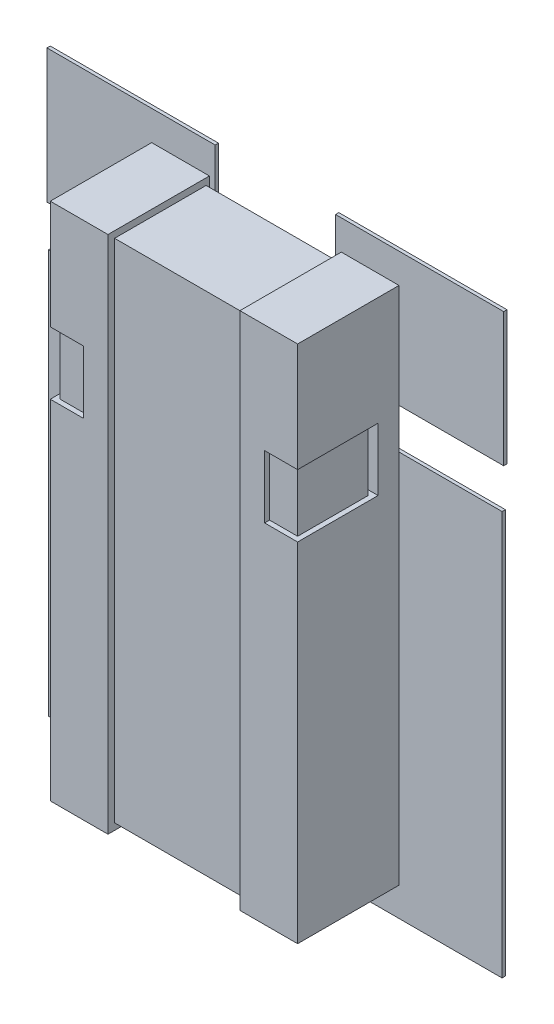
ISO-10303-21;
HEADER;
FILE_DESCRIPTION(('STEP AP214'),'2;1');
FILE_NAME('part.step','',(''),(''),'','','');
FILE_SCHEMA(('AUTOMOTIVE_DESIGN { 1 0 10303 214 1 1 1 1 }'));
ENDSEC;
DATA;
#1=APPLICATION_CONTEXT('core data for automotive mechanical design processes');
#2=APPLICATION_PROTOCOL_DEFINITION('international standard','automotive_design',2000,#1);
#3=PRODUCT_CONTEXT('',#1,'mechanical');
#4=PRODUCT('Part','Part','',(#3));
#5=PRODUCT_RELATED_PRODUCT_CATEGORY('part','',(#4));
#6=PRODUCT_DEFINITION_FORMATION('','',#4);
#7=PRODUCT_DEFINITION_CONTEXT('part definition',#1,'design');
#8=PRODUCT_DEFINITION('design','',#6,#7);
#9=PRODUCT_DEFINITION_SHAPE('','',#8);
#10=(LENGTH_UNIT() NAMED_UNIT(*) SI_UNIT(.MILLI.,.METRE.));
#11=(NAMED_UNIT(*) PLANE_ANGLE_UNIT() SI_UNIT($,.RADIAN.));
#12=(NAMED_UNIT(*) SI_UNIT($,.STERADIAN.) SOLID_ANGLE_UNIT());
#13=UNCERTAINTY_MEASURE_WITH_UNIT(LENGTH_MEASURE(1.E-05),#10,'distance_accuracy_value','');
#14=(GEOMETRIC_REPRESENTATION_CONTEXT(3) GLOBAL_UNCERTAINTY_ASSIGNED_CONTEXT((#13)) GLOBAL_UNIT_ASSIGNED_CONTEXT((#10,
#11,#12)) REPRESENTATION_CONTEXT('',''));
#15=CARTESIAN_POINT('',(0.,0.,0.));
#16=DIRECTION('',(0.,0.,1.));
#17=DIRECTION('',(1.,0.,0.));
#18=AXIS2_PLACEMENT_3D('',#15,#16,#17);
#19=CARTESIAN_POINT('',(0.550000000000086,0.534999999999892,0.7112));
#20=DIRECTION('',(0.,-1.,0.));
#21=DIRECTION('',(0.,0.,-1.));
#22=AXIS2_PLACEMENT_3D('',#19,#20,#21);
#23=PLANE('',#22);
#24=DIRECTION('',(-1.,0.,0.));
#25=VECTOR('',#24,1.);
#26=CARTESIAN_POINT('',(-0.750000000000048,0.534999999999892,0.68120000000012));
#27=LINE('',#26,#25);
#28=CARTESIAN_POINT('',(-0.550000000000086,0.534999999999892,0.68120000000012));
#29=VERTEX_POINT('',#28);
#30=CARTESIAN_POINT('',(-0.719999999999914,0.534999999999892,0.68120000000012));
#31=VERTEX_POINT('',#30);
#32=EDGE_CURVE('E378',#29,#31,#27,.T.);
#33=ORIENTED_EDGE('',*,*,#32,.T.);
#34=DIRECTION('',(0.,0.,-1.));
#35=VECTOR('',#34,1.);
#36=CARTESIAN_POINT('',(-0.719999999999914,0.534999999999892,0.223199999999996));
#37=LINE('',#36,#35);
#38=CARTESIAN_POINT('',(-0.719999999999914,0.534999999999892,0.253200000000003));
#39=VERTEX_POINT('',#38);
#40=EDGE_CURVE('E373',#31,#39,#37,.T.);
#41=ORIENTED_EDGE('',*,*,#40,.T.);
#42=DIRECTION('',(1.,0.,0.));
#43=VECTOR('',#42,1.);
#44=CARTESIAN_POINT('',(0.750000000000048,0.534999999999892,0.253200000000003));
#45=LINE('',#44,#43);
#46=CARTESIAN_POINT('',(0.719999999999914,0.534999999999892,0.253200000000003));
#47=VERTEX_POINT('',#46);
#48=EDGE_CURVE('E368',#39,#47,#45,.T.);
#49=ORIENTED_EDGE('',*,*,#48,.T.);
#50=DIRECTION('',(0.,0.,1.));
#51=VECTOR('',#50,1.);
#52=CARTESIAN_POINT('',(0.719999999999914,0.534999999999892,0.7112));
#53=LINE('',#52,#51);
#54=CARTESIAN_POINT('',(0.719999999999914,0.534999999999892,0.68120000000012));
#55=VERTEX_POINT('',#54);
#56=EDGE_CURVE('E357',#47,#55,#53,.T.);
#57=ORIENTED_EDGE('',*,*,#56,.T.);
#58=DIRECTION('',(1.,0.,0.));
#59=VECTOR('',#58,1.);
#60=CARTESIAN_POINT('',(0.550000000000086,0.534999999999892,0.68120000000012));
#61=LINE('',#60,#59);
#62=CARTESIAN_POINT('',(0.550000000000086,0.534999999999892,0.68120000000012));
#63=VERTEX_POINT('',#62);
#64=EDGE_CURVE('E329',#63,#55,#61,.T.);
#65=ORIENTED_EDGE('',*,*,#64,.F.);
#66=DIRECTION('',(0.,0.,-1.));
#67=VECTOR('',#66,1.);
#68=CARTESIAN_POINT('',(0.550000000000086,0.534999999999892,0.7112));
#69=LINE('',#68,#67);
#70=CARTESIAN_POINT('',(0.550000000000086,0.534999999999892,0.7112));
#71=VERTEX_POINT('',#70);
#72=EDGE_CURVE('E333',#71,#63,#69,.T.);
#73=ORIENTED_EDGE('',*,*,#72,.F.);
#74=DIRECTION('',(1.,0.,0.));
#75=VECTOR('',#74,1.);
#76=CARTESIAN_POINT('',(0.550000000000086,0.534999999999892,0.7112));
#77=LINE('',#76,#75);
#78=CARTESIAN_POINT('',(0.750000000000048,0.534999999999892,0.7112));
#79=VERTEX_POINT('',#78);
#80=EDGE_CURVE('E339',#79,#71,#77,.F.);
#81=ORIENTED_EDGE('',*,*,#80,.F.);
#82=DIRECTION('',(0.,0.,-1.));
#83=VECTOR('',#82,1.);
#84=CARTESIAN_POINT('',(0.750000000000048,0.534999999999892,0.7112));
#85=LINE('',#84,#83);
#86=CARTESIAN_POINT('',(0.750000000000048,0.534999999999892,0.223199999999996));
#87=VERTEX_POINT('',#86);
#88=EDGE_CURVE('E302',#87,#79,#85,.F.);
#89=ORIENTED_EDGE('',*,*,#88,.F.);
#90=DIRECTION('',(-1.,0.,0.));
#91=VECTOR('',#90,1.);
#92=CARTESIAN_POINT('',(0.750000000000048,0.534999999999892,0.223199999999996));
#93=LINE('',#92,#91);
#94=CARTESIAN_POINT('',(-0.750000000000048,0.534999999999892,0.223199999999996));
#95=VERTEX_POINT('',#94);
#96=EDGE_CURVE('E299',#87,#95,#93,.T.);
#97=ORIENTED_EDGE('',*,*,#96,.T.);
#98=DIRECTION('',(0.,0.,-1.));
#99=VECTOR('',#98,1.);
#100=CARTESIAN_POINT('',(-0.750000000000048,0.534999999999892,0.7112));
#101=LINE('',#100,#99);
#102=CARTESIAN_POINT('',(-0.750000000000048,0.534999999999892,0.7112));
#103=VERTEX_POINT('',#102);
#104=EDGE_CURVE('E296',#103,#95,#101,.T.);
#105=ORIENTED_EDGE('',*,*,#104,.F.);
#106=DIRECTION('',(1.,0.,0.));
#107=VECTOR('',#106,1.);
#108=CARTESIAN_POINT('',(0.550000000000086,0.534999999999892,0.7112));
#109=LINE('',#108,#107);
#110=CARTESIAN_POINT('',(-0.550000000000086,0.534999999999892,0.7112));
#111=VERTEX_POINT('',#110);
#112=EDGE_CURVE('E19',#111,#103,#109,.F.);
#113=ORIENTED_EDGE('',*,*,#112,.F.);
#114=DIRECTION('',(0.,0.,-1.));
#115=VECTOR('',#114,1.);
#116=CARTESIAN_POINT('',(-0.550000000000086,0.534999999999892,0.7112));
#117=LINE('',#116,#115);
#118=EDGE_CURVE('E324',#29,#111,#117,.F.);
#119=ORIENTED_EDGE('',*,*,#118,.F.);
#120=EDGE_LOOP('',(#33,#41,#49,#57,#65,#73,#81,#89,#97,#105,#113,#119));
#121=FACE_BOUND('',#120,.T.);
#122=ADVANCED_FACE('F16',(#121),#23,.F.);
#123=CARTESIAN_POINT('',(0.,0.,0.0762));
#124=DIRECTION('',(0.,0.,1.));
#125=DIRECTION('',(1.,0.,0.));
#126=AXIS2_PLACEMENT_3D('',#123,#124,#125);
#127=PLANE('',#126);
#128=DIRECTION('',(0.,1.,0.));
#129=VECTOR('',#128,1.);
#130=CARTESIAN_POINT('',(-0.365000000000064,0.94500000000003,0.0762));
#131=LINE('',#130,#129);
#132=CARTESIAN_POINT('',(-0.365000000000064,0.94500000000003,0.0762));
#133=VERTEX_POINT('',#132);
#134=CARTESIAN_POINT('',(-0.365000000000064,1.75500000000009,0.0762));
#135=VERTEX_POINT('',#134);
#136=EDGE_CURVE('E456',#133,#135,#131,.T.);
#137=ORIENTED_EDGE('',*,*,#136,.F.);
#138=DIRECTION('',(1.,0.,0.));
#139=VECTOR('',#138,1.);
#140=CARTESIAN_POINT('',(-1.38500000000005,0.94500000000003,0.0762));
#141=LINE('',#140,#139);
#142=CARTESIAN_POINT('',(-1.38500000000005,0.94500000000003,0.0762));
#143=VERTEX_POINT('',#142);
#144=EDGE_CURVE('E441',#143,#133,#141,.T.);
#145=ORIENTED_EDGE('',*,*,#144,.F.);
#146=DIRECTION('',(0.,1.,0.));
#147=VECTOR('',#146,1.);
#148=CARTESIAN_POINT('',(-1.38500000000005,1.75500000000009,0.0762));
#149=LINE('',#148,#147);
#150=CARTESIAN_POINT('',(-1.38500000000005,1.75500000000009,0.0762));
#151=VERTEX_POINT('',#150);
#152=EDGE_CURVE('E446',#151,#143,#149,.F.);
#153=ORIENTED_EDGE('',*,*,#152,.F.);
#154=DIRECTION('',(1.,0.,0.));
#155=VECTOR('',#154,1.);
#156=CARTESIAN_POINT('',(-0.365000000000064,1.75500000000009,0.0762));
#157=LINE('',#156,#155);
#158=EDGE_CURVE('E451',#135,#151,#157,.F.);
#159=ORIENTED_EDGE('',*,*,#158,.F.);
#160=EDGE_LOOP('',(#137,#145,#153,#159));
#161=FACE_BOUND('',#160,.T.);
#162=ADVANCED_FACE('F1171',(#161),#127,.F.);
#163=CARTESIAN_POINT('',(0.,0.,0.0762));
#164=DIRECTION('',(0.,0.,1.));
#165=DIRECTION('',(1.,0.,0.));
#166=AXIS2_PLACEMENT_3D('',#163,#164,#165);
#167=PLANE('',#166);
#168=DIRECTION('',(1.,0.,0.));
#169=VECTOR('',#168,1.);
#170=CARTESIAN_POINT('',(-1.37500000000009,-1.75000000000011,0.0762));
#171=LINE('',#170,#169);
#172=CARTESIAN_POINT('',(-1.37500000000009,-1.75000000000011,0.0762));
#173=VERTEX_POINT('',#172);
#174=CARTESIAN_POINT('',(-0.375000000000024,-1.75000000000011,0.0762));
#175=VERTEX_POINT('',#174);
#176=EDGE_CURVE('E431',#173,#175,#171,.T.);
#177=ORIENTED_EDGE('',*,*,#176,.F.);
#178=DIRECTION('',(0.,1.,0.));
#179=VECTOR('',#178,1.);
#180=CARTESIAN_POINT('',(-1.37500000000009,0.699999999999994,0.0762));
#181=LINE('',#180,#179);
#182=CARTESIAN_POINT('',(-1.37500000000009,0.699999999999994,0.0762));
#183=VERTEX_POINT('',#182);
#184=EDGE_CURVE('E436',#183,#173,#181,.F.);
#185=ORIENTED_EDGE('',*,*,#184,.F.);
#186=DIRECTION('',(1.,0.,0.));
#187=VECTOR('',#186,1.);
#188=CARTESIAN_POINT('',(0.,0.699999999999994,0.0762));
#189=LINE('',#188,#187);
#190=CARTESIAN_POINT('',(-0.375000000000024,0.699999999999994,0.0762));
#191=VERTEX_POINT('',#190);
#192=EDGE_CURVE('E328',#191,#183,#189,.F.);
#193=ORIENTED_EDGE('',*,*,#192,.F.);
#194=DIRECTION('',(0.,1.,0.));
#195=VECTOR('',#194,1.);
#196=CARTESIAN_POINT('',(-0.375000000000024,-1.75000000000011,0.0762));
#197=LINE('',#196,#195);
#198=EDGE_CURVE('E425',#175,#191,#197,.T.);
#199=ORIENTED_EDGE('',*,*,#198,.F.);
#200=EDGE_LOOP('',(#177,#185,#193,#199));
#201=FACE_BOUND('',#200,.T.);
#202=ADVANCED_FACE('F1161',(#201),#167,.F.);
#203=CARTESIAN_POINT('',(0.,0.,0.0762));
#204=DIRECTION('',(0.,0.,1.));
#205=DIRECTION('',(1.,0.,0.));
#206=AXIS2_PLACEMENT_3D('',#203,#204,#205);
#207=PLANE('',#206);
#208=DIRECTION('',(1.,0.,0.));
#209=VECTOR('',#208,1.);
#210=CARTESIAN_POINT('',(0.375000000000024,-1.75000000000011,0.0762));
#211=LINE('',#210,#209);
#212=CARTESIAN_POINT('',(0.375000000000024,-1.75000000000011,0.0762));
#213=VERTEX_POINT('',#212);
#214=CARTESIAN_POINT('',(1.37500000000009,-1.75000000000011,0.0762));
#215=VERTEX_POINT('',#214);
#216=EDGE_CURVE('E397',#213,#215,#211,.T.);
#217=ORIENTED_EDGE('',*,*,#216,.F.);
#218=DIRECTION('',(0.,1.,0.));
#219=VECTOR('',#218,1.);
#220=CARTESIAN_POINT('',(0.375000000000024,0.699999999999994,0.0762));
#221=LINE('',#220,#219);
#222=CARTESIAN_POINT('',(0.375000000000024,0.699999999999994,0.0762));
#223=VERTEX_POINT('',#222);
#224=EDGE_CURVE('E395',#223,#213,#221,.F.);
#225=ORIENTED_EDGE('',*,*,#224,.F.);
#226=DIRECTION('',(1.,0.,0.));
#227=VECTOR('',#226,1.);
#228=CARTESIAN_POINT('',(0.,0.699999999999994,0.0762));
#229=LINE('',#228,#227);
#230=CARTESIAN_POINT('',(1.37500000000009,0.699999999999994,0.0762));
#231=VERTEX_POINT('',#230);
#232=EDGE_CURVE('E331',#231,#223,#229,.F.);
#233=ORIENTED_EDGE('',*,*,#232,.F.);
#234=DIRECTION('',(0.,1.,0.));
#235=VECTOR('',#234,1.);
#236=CARTESIAN_POINT('',(1.37500000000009,-1.75000000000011,0.0762));
#237=LINE('',#236,#235);
#238=EDGE_CURVE('E411',#215,#231,#237,.T.);
#239=ORIENTED_EDGE('',*,*,#238,.F.);
#240=EDGE_LOOP('',(#217,#225,#233,#239));
#241=FACE_BOUND('',#240,.T.);
#242=ADVANCED_FACE('F396',(#241),#207,.F.);
#243=CARTESIAN_POINT('',(0.,0.,0.0762));
#244=DIRECTION('',(0.,0.,1.));
#245=DIRECTION('',(1.,0.,0.));
#246=AXIS2_PLACEMENT_3D('',#243,#244,#245);
#247=PLANE('',#246);
#248=DIRECTION('',(1.,0.,0.));
#249=VECTOR('',#248,1.);
#250=CARTESIAN_POINT('',(0.365000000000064,0.94500000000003,0.0762));
#251=LINE('',#250,#249);
#252=CARTESIAN_POINT('',(0.365000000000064,0.94500000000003,0.0762));
#253=VERTEX_POINT('',#252);
#254=CARTESIAN_POINT('',(1.38500000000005,0.94500000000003,0.0762));
#255=VERTEX_POINT('',#254);
#256=EDGE_CURVE('E497',#253,#255,#251,.T.);
#257=ORIENTED_EDGE('',*,*,#256,.F.);
#258=DIRECTION('',(0.,1.,0.));
#259=VECTOR('',#258,1.);
#260=CARTESIAN_POINT('',(0.365000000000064,1.75500000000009,0.0762));
#261=LINE('',#260,#259);
#262=CARTESIAN_POINT('',(0.365000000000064,1.75500000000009,0.0762));
#263=VERTEX_POINT('',#262);
#264=EDGE_CURVE('E502',#263,#253,#261,.F.);
#265=ORIENTED_EDGE('',*,*,#264,.F.);
#266=DIRECTION('',(1.,0.,0.));
#267=VECTOR('',#266,1.);
#268=CARTESIAN_POINT('',(1.38500000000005,1.75500000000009,0.0762));
#269=LINE('',#268,#267);
#270=CARTESIAN_POINT('',(1.38500000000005,1.75500000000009,0.0762));
#271=VERTEX_POINT('',#270);
#272=EDGE_CURVE('E507',#271,#263,#269,.F.);
#273=ORIENTED_EDGE('',*,*,#272,.F.);
#274=DIRECTION('',(0.,1.,0.));
#275=VECTOR('',#274,1.);
#276=CARTESIAN_POINT('',(1.38500000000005,0.94500000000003,0.0762));
#277=LINE('',#276,#275);
#278=EDGE_CURVE('E407',#255,#271,#277,.T.);
#279=ORIENTED_EDGE('',*,*,#278,.F.);
#280=EDGE_LOOP('',(#257,#265,#273,#279));
#281=FACE_BOUND('',#280,.T.);
#282=ADVANCED_FACE('F522',(#281),#247,.F.);
#283=CARTESIAN_POINT('',(-0.750000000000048,0.534999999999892,0.68120000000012));
#284=DIRECTION('',(0.,0.,-1.));
#285=DIRECTION('',(-1.,0.,0.));
#286=AXIS2_PLACEMENT_3D('',#283,#284,#285);
#287=PLANE('',#286);
#288=DIRECTION('',(0.,1.,0.));
#289=VECTOR('',#288,1.);
#290=CARTESIAN_POINT('',(-0.550000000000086,-1.57500000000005,0.68120000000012));
#291=LINE('',#290,#289);
#292=CARTESIAN_POINT('',(-0.550000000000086,0.914999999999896,0.68120000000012));
#293=VERTEX_POINT('',#292);
#294=EDGE_CURVE('E326',#29,#293,#291,.T.);
#295=ORIENTED_EDGE('',*,*,#294,.T.);
#296=DIRECTION('',(1.,0.,0.));
#297=VECTOR('',#296,1.);
#298=CARTESIAN_POINT('',(0.550000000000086,0.914999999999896,0.68120000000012));
#299=LINE('',#298,#297);
#300=CARTESIAN_POINT('',(-0.719999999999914,0.914999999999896,0.68120000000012));
#301=VERTEX_POINT('',#300);
#302=EDGE_CURVE('E490',#293,#301,#299,.F.);
#303=ORIENTED_EDGE('',*,*,#302,.T.);
#304=DIRECTION('',(0.,1.,0.));
#305=VECTOR('',#304,1.);
#306=CARTESIAN_POINT('',(-0.719999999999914,0.534999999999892,0.68120000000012));
#307=LINE('',#306,#305);
#308=EDGE_CURVE('E375',#301,#31,#307,.F.);
#309=ORIENTED_EDGE('',*,*,#308,.T.);
#310=ORIENTED_EDGE('',*,*,#32,.F.);
#311=EDGE_LOOP('',(#295,#303,#309,#310));
#312=FACE_BOUND('',#311,.T.);
#313=ADVANCED_FACE('F637',(#312),#287,.F.);
#314=CARTESIAN_POINT('',(-0.719999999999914,0.534999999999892,0.223199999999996));
#315=DIRECTION('',(1.,0.,0.));
#316=DIRECTION('',(0.,0.,-1.));
#317=AXIS2_PLACEMENT_3D('',#314,#315,#316);
#318=PLANE('',#317);
#319=ORIENTED_EDGE('',*,*,#308,.F.);
#320=DIRECTION('',(0.,0.,1.));
#321=VECTOR('',#320,1.);
#322=CARTESIAN_POINT('',(-0.719999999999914,0.914999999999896,0.68120000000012));
#323=LINE('',#322,#321);
#324=CARTESIAN_POINT('',(-0.719999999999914,0.914999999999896,0.253200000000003));
#325=VERTEX_POINT('',#324);
#326=EDGE_CURVE('E487',#301,#325,#323,.F.);
#327=ORIENTED_EDGE('',*,*,#326,.T.);
#328=DIRECTION('',(0.,1.,0.));
#329=VECTOR('',#328,1.);
#330=CARTESIAN_POINT('',(-0.719999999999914,0.534999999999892,0.253200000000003));
#331=LINE('',#330,#329);
#332=EDGE_CURVE('E370',#325,#39,#331,.F.);
#333=ORIENTED_EDGE('',*,*,#332,.T.);
#334=ORIENTED_EDGE('',*,*,#40,.F.);
#335=EDGE_LOOP('',(#319,#327,#333,#334));
#336=FACE_BOUND('',#335,.T.);
#337=ADVANCED_FACE('F641',(#336),#318,.F.);
#338=CARTESIAN_POINT('',(0.750000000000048,0.534999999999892,0.253200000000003));
#339=DIRECTION('',(0.,0.,1.));
#340=DIRECTION('',(1.,0.,0.));
#341=AXIS2_PLACEMENT_3D('',#338,#339,#340);
#342=PLANE('',#341);
#343=ORIENTED_EDGE('',*,*,#332,.F.);
#344=DIRECTION('',(1.,0.,0.));
#345=VECTOR('',#344,1.);
#346=CARTESIAN_POINT('',(0.550000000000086,0.914999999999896,0.253200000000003));
#347=LINE('',#346,#345);
#348=CARTESIAN_POINT('',(0.719999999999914,0.914999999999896,0.253200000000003));
#349=VERTEX_POINT('',#348);
#350=EDGE_CURVE('E482',#325,#349,#347,.T.);
#351=ORIENTED_EDGE('',*,*,#350,.T.);
#352=DIRECTION('',(0.,1.,0.));
#353=VECTOR('',#352,1.);
#354=CARTESIAN_POINT('',(0.719999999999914,0.534999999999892,0.253200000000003));
#355=LINE('',#354,#353);
#356=EDGE_CURVE('E362',#349,#47,#355,.F.);
#357=ORIENTED_EDGE('',*,*,#356,.T.);
#358=ORIENTED_EDGE('',*,*,#48,.F.);
#359=EDGE_LOOP('',(#343,#351,#357,#358));
#360=FACE_BOUND('',#359,.T.);
#361=ADVANCED_FACE('F643',(#360),#342,.F.);
#362=CARTESIAN_POINT('',(0.719999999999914,0.534999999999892,0.7112));
#363=DIRECTION('',(-1.,0.,0.));
#364=DIRECTION('',(0.,0.,1.));
#365=AXIS2_PLACEMENT_3D('',#362,#363,#364);
#366=PLANE('',#365);
#367=ORIENTED_EDGE('',*,*,#356,.F.);
#368=DIRECTION('',(0.,0.,1.));
#369=VECTOR('',#368,1.);
#370=CARTESIAN_POINT('',(0.719999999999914,0.914999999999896,0.68120000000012));
#371=LINE('',#370,#369);
#372=CARTESIAN_POINT('',(0.719999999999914,0.914999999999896,0.68120000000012));
#373=VERTEX_POINT('',#372);
#374=EDGE_CURVE('E464',#349,#373,#371,.T.);
#375=ORIENTED_EDGE('',*,*,#374,.T.);
#376=DIRECTION('',(0.,1.,0.));
#377=VECTOR('',#376,1.);
#378=CARTESIAN_POINT('',(0.719999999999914,0.534999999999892,0.68120000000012));
#379=LINE('',#378,#377);
#380=EDGE_CURVE('E359',#373,#55,#379,.F.);
#381=ORIENTED_EDGE('',*,*,#380,.T.);
#382=ORIENTED_EDGE('',*,*,#56,.F.);
#383=EDGE_LOOP('',(#367,#375,#381,#382));
#384=FACE_BOUND('',#383,.T.);
#385=ADVANCED_FACE('F462',(#384),#366,.F.);
#386=CARTESIAN_POINT('',(0.750000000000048,0.914999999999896,0.223199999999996));
#387=DIRECTION('',(0.,0.,-1.));
#388=DIRECTION('',(-1.,0.,0.));
#389=AXIS2_PLACEMENT_3D('',#386,#387,#388);
#390=PLANE('',#389);
#391=DIRECTION('',(1.,0.,0.));
#392=VECTOR('',#391,1.);
#393=CARTESIAN_POINT('',(0.550000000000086,0.914999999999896,0.223199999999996));
#394=LINE('',#393,#392);
#395=CARTESIAN_POINT('',(0.750000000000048,0.914999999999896,0.223199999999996));
#396=VERTEX_POINT('',#395);
#397=CARTESIAN_POINT('',(-0.750000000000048,0.914999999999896,0.223199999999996));
#398=VERTEX_POINT('',#397);
#399=EDGE_CURVE('E478',#396,#398,#394,.F.);
#400=ORIENTED_EDGE('',*,*,#399,.T.);
#401=DIRECTION('',(0.,1.,0.));
#402=VECTOR('',#401,1.);
#403=CARTESIAN_POINT('',(-0.750000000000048,0.534999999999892,0.223199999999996));
#404=LINE('',#403,#402);
#405=EDGE_CURVE('E356',#95,#398,#404,.T.);
#406=ORIENTED_EDGE('',*,*,#405,.F.);
#407=ORIENTED_EDGE('',*,*,#96,.F.);
#408=DIRECTION('',(0.,1.,0.));
#409=VECTOR('',#408,1.);
#410=CARTESIAN_POINT('',(0.750000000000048,0.914999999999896,0.223199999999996));
#411=LINE('',#410,#409);
#412=EDGE_CURVE('E351',#396,#87,#411,.F.);
#413=ORIENTED_EDGE('',*,*,#412,.F.);
#414=EDGE_LOOP('',(#400,#406,#407,#413));
#415=FACE_BOUND('',#414,.T.);
#416=ADVANCED_FACE('F354',(#415),#390,.F.);
#417=CARTESIAN_POINT('',(0.550000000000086,0.534999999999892,0.68120000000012));
#418=DIRECTION('',(0.,0.,-1.));
#419=DIRECTION('',(-1.,0.,0.));
#420=AXIS2_PLACEMENT_3D('',#417,#418,#419);
#421=PLANE('',#420);
#422=ORIENTED_EDGE('',*,*,#380,.F.);
#423=DIRECTION('',(1.,0.,0.));
#424=VECTOR('',#423,1.);
#425=CARTESIAN_POINT('',(0.550000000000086,0.914999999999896,0.68120000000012));
#426=LINE('',#425,#424);
#427=CARTESIAN_POINT('',(0.550000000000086,0.914999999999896,0.68120000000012));
#428=VERTEX_POINT('',#427);
#429=EDGE_CURVE('E470',#373,#428,#426,.F.);
#430=ORIENTED_EDGE('',*,*,#429,.T.);
#431=DIRECTION('',(0.,1.,0.));
#432=VECTOR('',#431,1.);
#433=CARTESIAN_POINT('',(0.550000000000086,-1.57500000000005,0.68120000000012));
#434=LINE('',#433,#432);
#435=EDGE_CURVE('E626',#63,#428,#434,.T.);
#436=ORIENTED_EDGE('',*,*,#435,.F.);
#437=ORIENTED_EDGE('',*,*,#64,.T.);
#438=EDGE_LOOP('',(#422,#430,#436,#437));
#439=FACE_BOUND('',#438,.T.);
#440=ADVANCED_FACE('F468',(#439),#421,.F.);
#441=CARTESIAN_POINT('',(-0.550000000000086,-1.57500000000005,0.7112));
#442=DIRECTION('',(1.,0.,0.));
#443=DIRECTION('',(0.,0.,-1.));
#444=AXIS2_PLACEMENT_3D('',#441,#442,#443);
#445=PLANE('',#444);
#446=ORIENTED_EDGE('',*,*,#294,.F.);
#447=ORIENTED_EDGE('',*,*,#118,.T.);
#448=DIRECTION('',(0.,1.,0.));
#449=VECTOR('',#448,1.);
#450=CARTESIAN_POINT('',(-0.550000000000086,0.,0.7112));
#451=LINE('',#450,#449);
#452=CARTESIAN_POINT('',(-0.550000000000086,0.914999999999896,0.7112));
#453=VERTEX_POINT('',#452);
#454=EDGE_CURVE('E315',#453,#111,#451,.F.);
#455=ORIENTED_EDGE('',*,*,#454,.F.);
#456=DIRECTION('',(0.,0.,1.));
#457=VECTOR('',#456,1.);
#458=CARTESIAN_POINT('',(-0.550000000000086,0.914999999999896,0.68120000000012));
#459=LINE('',#458,#457);
#460=EDGE_CURVE('E493',#453,#293,#459,.F.);
#461=ORIENTED_EDGE('',*,*,#460,.T.);
#462=EDGE_LOOP('',(#446,#447,#455,#461));
#463=FACE_BOUND('',#462,.T.);
#464=ADVANCED_FACE('F325',(#463),#445,.F.);
#465=CARTESIAN_POINT('',(-0.365000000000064,0.94500000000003,0.0762));
#466=DIRECTION('',(1.,0.,0.));
#467=DIRECTION('',(0.,0.,-1.));
#468=AXIS2_PLACEMENT_3D('',#465,#466,#467);
#469=PLANE('',#468);
#470=DIRECTION('',(0.,0.,-1.));
#471=VECTOR('',#470,1.);
#472=CARTESIAN_POINT('',(-0.365000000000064,0.94500000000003,0.0762));
#473=LINE('',#472,#471);
#474=CARTESIAN_POINT('',(-0.365000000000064,0.94500000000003,0.0961999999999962));
#475=VERTEX_POINT('',#474);
#476=EDGE_CURVE('E439',#133,#475,#473,.F.);
#477=ORIENTED_EDGE('',*,*,#476,.F.);
#478=ORIENTED_EDGE('',*,*,#136,.T.);
#479=DIRECTION('',(0.,0.,1.));
#480=VECTOR('',#479,1.);
#481=CARTESIAN_POINT('',(-0.365000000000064,1.75500000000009,0.0762));
#482=LINE('',#481,#480);
#483=CARTESIAN_POINT('',(-0.365000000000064,1.75500000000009,0.0961999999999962));
#484=VERTEX_POINT('',#483);
#485=EDGE_CURVE('E453',#484,#135,#482,.F.);
#486=ORIENTED_EDGE('',*,*,#485,.F.);
#487=DIRECTION('',(0.,1.,0.));
#488=VECTOR('',#487,1.);
#489=CARTESIAN_POINT('',(-0.365000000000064,0.,0.0961999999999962));
#490=LINE('',#489,#488);
#491=EDGE_CURVE('E608',#475,#484,#490,.T.);
#492=ORIENTED_EDGE('',*,*,#491,.F.);
#493=EDGE_LOOP('',(#477,#478,#486,#492));
#494=FACE_BOUND('',#493,.T.);
#495=ADVANCED_FACE('F1082',(#494),#469,.T.);
#496=CARTESIAN_POINT('',(-0.365000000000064,1.75500000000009,0.0762));
#497=DIRECTION('',(0.,1.,0.));
#498=DIRECTION('',(0.,0.,1.));
#499=AXIS2_PLACEMENT_3D('',#496,#497,#498);
#500=PLANE('',#499);
#501=ORIENTED_EDGE('',*,*,#485,.T.);
#502=ORIENTED_EDGE('',*,*,#158,.T.);
#503=DIRECTION('',(0.,0.,1.));
#504=VECTOR('',#503,1.);
#505=CARTESIAN_POINT('',(-1.38500000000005,1.75500000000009,0.0762));
#506=LINE('',#505,#504);
#507=CARTESIAN_POINT('',(-1.38500000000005,1.75500000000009,0.0961999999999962));
#508=VERTEX_POINT('',#507);
#509=EDGE_CURVE('E448',#508,#151,#506,.F.);
#510=ORIENTED_EDGE('',*,*,#509,.F.);
#511=DIRECTION('',(1.,0.,0.));
#512=VECTOR('',#511,1.);
#513=CARTESIAN_POINT('',(0.,1.75500000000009,0.0961999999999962));
#514=LINE('',#513,#512);
#515=EDGE_CURVE('E606',#484,#508,#514,.F.);
#516=ORIENTED_EDGE('',*,*,#515,.F.);
#517=EDGE_LOOP('',(#501,#502,#510,#516));
#518=FACE_BOUND('',#517,.T.);
#519=ADVANCED_FACE('F1071',(#518),#500,.T.);
#520=CARTESIAN_POINT('',(-1.38500000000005,1.75500000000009,0.0762));
#521=DIRECTION('',(-1.,0.,0.));
#522=DIRECTION('',(0.,0.,1.));
#523=AXIS2_PLACEMENT_3D('',#520,#521,#522);
#524=PLANE('',#523);
#525=ORIENTED_EDGE('',*,*,#509,.T.);
#526=ORIENTED_EDGE('',*,*,#152,.T.);
#527=DIRECTION('',(0.,0.,-1.));
#528=VECTOR('',#527,1.);
#529=CARTESIAN_POINT('',(-1.38500000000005,0.94500000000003,0.0762));
#530=LINE('',#529,#528);
#531=CARTESIAN_POINT('',(-1.38500000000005,0.94500000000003,0.0961999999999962));
#532=VERTEX_POINT('',#531);
#533=EDGE_CURVE('E443',#532,#143,#530,.T.);
#534=ORIENTED_EDGE('',*,*,#533,.F.);
#535=DIRECTION('',(0.,1.,0.));
#536=VECTOR('',#535,1.);
#537=CARTESIAN_POINT('',(-1.38500000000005,0.,0.0961999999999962));
#538=LINE('',#537,#536);
#539=EDGE_CURVE('E604',#508,#532,#538,.F.);
#540=ORIENTED_EDGE('',*,*,#539,.F.);
#541=EDGE_LOOP('',(#525,#526,#534,#540));
#542=FACE_BOUND('',#541,.T.);
#543=ADVANCED_FACE('F1060',(#542),#524,.T.);
#544=CARTESIAN_POINT('',(-1.38500000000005,0.94500000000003,0.0762));
#545=DIRECTION('',(0.,-1.,0.));
#546=DIRECTION('',(0.,0.,-1.));
#547=AXIS2_PLACEMENT_3D('',#544,#545,#546);
#548=PLANE('',#547);
#549=DIRECTION('',(1.,0.,0.));
#550=VECTOR('',#549,1.);
#551=CARTESIAN_POINT('',(0.,0.94500000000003,0.0961999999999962));
#552=LINE('',#551,#550);
#553=CARTESIAN_POINT('',(-0.399999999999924,0.94500000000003,0.0961999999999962));
#554=VERTEX_POINT('',#553);
#555=CARTESIAN_POINT('',(-0.750000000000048,0.94500000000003,0.0961999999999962));
#556=VERTEX_POINT('',#555);
#557=EDGE_CURVE('E599',#554,#556,#552,.F.);
#558=ORIENTED_EDGE('',*,*,#557,.T.);
#559=DIRECTION('',(1.,0.,0.));
#560=VECTOR('',#559,1.);
#561=CARTESIAN_POINT('',(0.,0.94500000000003,0.0961999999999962));
#562=LINE('',#561,#560);
#563=EDGE_CURVE('E602',#532,#556,#562,.T.);
#564=ORIENTED_EDGE('',*,*,#563,.F.);
#565=ORIENTED_EDGE('',*,*,#533,.T.);
#566=ORIENTED_EDGE('',*,*,#144,.T.);
#567=ORIENTED_EDGE('',*,*,#476,.T.);
#568=DIRECTION('',(1.,0.,0.));
#569=VECTOR('',#568,1.);
#570=CARTESIAN_POINT('',(0.,0.94500000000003,0.0961999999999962));
#571=LINE('',#570,#569);
#572=EDGE_CURVE('E610',#554,#475,#571,.T.);
#573=ORIENTED_EDGE('',*,*,#572,.F.);
#574=EDGE_LOOP('',(#558,#564,#565,#566,#567,#573));
#575=FACE_BOUND('',#574,.T.);
#576=ADVANCED_FACE('F1054',(#575),#548,.T.);
#577=CARTESIAN_POINT('',(-0.750000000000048,0.534999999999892,0.0762));
#578=DIRECTION('',(-1.,0.,0.));
#579=DIRECTION('',(0.,0.,1.));
#580=AXIS2_PLACEMENT_3D('',#577,#578,#579);
#581=PLANE('',#580);
#582=DIRECTION('',(0.,1.,0.));
#583=VECTOR('',#582,1.);
#584=CARTESIAN_POINT('',(-0.750000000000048,0.,0.7112));
#585=LINE('',#584,#583);
#586=CARTESIAN_POINT('',(-0.750000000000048,-1.57500000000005,0.7112));
#587=VERTEX_POINT('',#586);
#588=EDGE_CURVE('E304',#103,#587,#585,.F.);
#589=ORIENTED_EDGE('',*,*,#588,.F.);
#590=ORIENTED_EDGE('',*,*,#104,.T.);
#591=ORIENTED_EDGE('',*,*,#405,.T.);
#592=DIRECTION('',(0.,0.,1.));
#593=VECTOR('',#592,1.);
#594=CARTESIAN_POINT('',(-0.750000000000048,0.914999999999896,0.68120000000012));
#595=LINE('',#594,#593);
#596=CARTESIAN_POINT('',(-0.750000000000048,0.914999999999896,0.7112));
#597=VERTEX_POINT('',#596);
#598=EDGE_CURVE('E480',#398,#597,#595,.T.);
#599=ORIENTED_EDGE('',*,*,#598,.T.);
#600=DIRECTION('',(0.,1.,0.));
#601=VECTOR('',#600,1.);
#602=CARTESIAN_POINT('',(-0.750000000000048,0.,0.7112));
#603=LINE('',#602,#601);
#604=CARTESIAN_POINT('',(-0.750000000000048,1.57500000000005,0.7112));
#605=VERTEX_POINT('',#604);
#606=EDGE_CURVE('E621',#605,#597,#603,.F.);
#607=ORIENTED_EDGE('',*,*,#606,.F.);
#608=DIRECTION('',(0.,0.,1.));
#609=VECTOR('',#608,1.);
#610=CARTESIAN_POINT('',(-0.750000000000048,1.57500000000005,0.0762));
#611=LINE('',#610,#609);
#612=CARTESIAN_POINT('',(-0.750000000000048,1.57500000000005,0.0961999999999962));
#613=VERTEX_POINT('',#612);
#614=EDGE_CURVE('E321',#613,#605,#611,.T.);
#615=ORIENTED_EDGE('',*,*,#614,.F.);
#616=DIRECTION('',(0.,1.,0.));
#617=VECTOR('',#616,1.);
#618=CARTESIAN_POINT('',(-0.750000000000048,0.,0.0961999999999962));
#619=LINE('',#618,#617);
#620=EDGE_CURVE('E615',#556,#613,#619,.T.);
#621=ORIENTED_EDGE('',*,*,#620,.F.);
#622=DIRECTION('',(0.,1.,0.));
#623=VECTOR('',#622,1.);
#624=CARTESIAN_POINT('',(-0.750000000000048,0.,0.0961999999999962));
#625=LINE('',#624,#623);
#626=CARTESIAN_POINT('',(-0.750000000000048,0.699999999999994,0.0961999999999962));
#627=VERTEX_POINT('',#626);
#628=EDGE_CURVE('E596',#556,#627,#625,.F.);
#629=ORIENTED_EDGE('',*,*,#628,.T.);
#630=DIRECTION('',(0.,1.,0.));
#631=VECTOR('',#630,1.);
#632=CARTESIAN_POINT('',(-0.750000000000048,0.,0.0961999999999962));
#633=LINE('',#632,#631);
#634=CARTESIAN_POINT('',(-0.750000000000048,-1.57500000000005,0.0961999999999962));
#635=VERTEX_POINT('',#634);
#636=EDGE_CURVE('E587',#635,#627,#633,.T.);
#637=ORIENTED_EDGE('',*,*,#636,.F.);
#638=DIRECTION('',(0.,0.,-1.));
#639=VECTOR('',#638,1.);
#640=CARTESIAN_POINT('',(-0.750000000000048,-1.57500000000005,0.0762));
#641=LINE('',#640,#639);
#642=EDGE_CURVE('E307',#587,#635,#641,.T.);
#643=ORIENTED_EDGE('',*,*,#642,.F.);
#644=EDGE_LOOP('',(#589,#590,#591,#599,#607,#615,#621,#629,#637,#643));
#645=FACE_BOUND('',#644,.T.);
#646=ADVANCED_FACE('F305',(#645),#581,.T.);
#647=CARTESIAN_POINT('',(-1.37500000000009,0.699999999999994,0.0762));
#648=DIRECTION('',(-1.,0.,0.));
#649=DIRECTION('',(0.,0.,1.));
#650=AXIS2_PLACEMENT_3D('',#647,#648,#649);
#651=PLANE('',#650);
#652=DIRECTION('',(0.,0.,1.));
#653=VECTOR('',#652,1.);
#654=CARTESIAN_POINT('',(-1.37500000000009,0.699999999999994,0.0762));
#655=LINE('',#654,#653);
#656=CARTESIAN_POINT('',(-1.37500000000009,0.699999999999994,0.0961999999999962));
#657=VERTEX_POINT('',#656);
#658=EDGE_CURVE('E402',#183,#657,#655,.T.);
#659=ORIENTED_EDGE('',*,*,#658,.F.);
#660=ORIENTED_EDGE('',*,*,#184,.T.);
#661=DIRECTION('',(0.,0.,-1.));
#662=VECTOR('',#661,1.);
#663=CARTESIAN_POINT('',(-1.37500000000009,-1.75000000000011,0.0762));
#664=LINE('',#663,#662);
#665=CARTESIAN_POINT('',(-1.37500000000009,-1.75000000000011,0.0961999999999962));
#666=VERTEX_POINT('',#665);
#667=EDGE_CURVE('E433',#666,#173,#664,.T.);
#668=ORIENTED_EDGE('',*,*,#667,.F.);
#669=DIRECTION('',(0.,1.,0.));
#670=VECTOR('',#669,1.);
#671=CARTESIAN_POINT('',(-1.37500000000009,0.,0.0961999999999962));
#672=LINE('',#671,#670);
#673=EDGE_CURVE('E582',#657,#666,#672,.F.);
#674=ORIENTED_EDGE('',*,*,#673,.F.);
#675=EDGE_LOOP('',(#659,#660,#668,#674));
#676=FACE_BOUND('',#675,.T.);
#677=ADVANCED_FACE('F1034',(#676),#651,.T.);
#678=CARTESIAN_POINT('',(-1.37500000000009,-1.75000000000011,0.0762));
#679=DIRECTION('',(0.,-1.,0.));
#680=DIRECTION('',(0.,0.,-1.));
#681=AXIS2_PLACEMENT_3D('',#678,#679,#680);
#682=PLANE('',#681);
#683=ORIENTED_EDGE('',*,*,#667,.T.);
#684=ORIENTED_EDGE('',*,*,#176,.T.);
#685=DIRECTION('',(0.,0.,-1.));
#686=VECTOR('',#685,1.);
#687=CARTESIAN_POINT('',(-0.375000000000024,-1.75000000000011,0.0762));
#688=LINE('',#687,#686);
#689=CARTESIAN_POINT('',(-0.375000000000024,-1.75000000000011,0.0961999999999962));
#690=VERTEX_POINT('',#689);
#691=EDGE_CURVE('E428',#690,#175,#688,.T.);
#692=ORIENTED_EDGE('',*,*,#691,.F.);
#693=DIRECTION('',(1.,0.,0.));
#694=VECTOR('',#693,1.);
#695=CARTESIAN_POINT('',(0.,-1.75000000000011,0.0961999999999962));
#696=LINE('',#695,#694);
#697=EDGE_CURVE('E580',#666,#690,#696,.T.);
#698=ORIENTED_EDGE('',*,*,#697,.F.);
#699=EDGE_LOOP('',(#683,#684,#692,#698));
#700=FACE_BOUND('',#699,.T.);
#701=ADVANCED_FACE('F1027',(#700),#682,.T.);
#702=CARTESIAN_POINT('',(-0.375000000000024,-1.75000000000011,0.0762));
#703=DIRECTION('',(1.,0.,0.));
#704=DIRECTION('',(0.,0.,-1.));
#705=AXIS2_PLACEMENT_3D('',#702,#703,#704);
#706=PLANE('',#705);
#707=ORIENTED_EDGE('',*,*,#691,.T.);
#708=ORIENTED_EDGE('',*,*,#198,.T.);
#709=DIRECTION('',(0.,0.,1.));
#710=VECTOR('',#709,1.);
#711=CARTESIAN_POINT('',(-0.375000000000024,0.699999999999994,0.0762));
#712=LINE('',#711,#710);
#713=CARTESIAN_POINT('',(-0.375000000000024,0.699999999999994,0.0961999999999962));
#714=VERTEX_POINT('',#713);
#715=EDGE_CURVE('E422',#714,#191,#712,.F.);
#716=ORIENTED_EDGE('',*,*,#715,.F.);
#717=DIRECTION('',(0.,1.,0.));
#718=VECTOR('',#717,1.);
#719=CARTESIAN_POINT('',(-0.375000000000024,0.,0.0961999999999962));
#720=LINE('',#719,#718);
#721=EDGE_CURVE('E578',#690,#714,#720,.T.);
#722=ORIENTED_EDGE('',*,*,#721,.F.);
#723=EDGE_LOOP('',(#707,#708,#716,#722));
#724=FACE_BOUND('',#723,.T.);
#725=ADVANCED_FACE('F1033',(#724),#706,.T.);
#726=CARTESIAN_POINT('',(-0.375000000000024,0.699999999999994,0.0762));
#727=DIRECTION('',(0.,1.,0.));
#728=DIRECTION('',(0.,0.,1.));
#729=AXIS2_PLACEMENT_3D('',#726,#727,#728);
#730=PLANE('',#729);
#731=DIRECTION('',(1.,0.,0.));
#732=VECTOR('',#731,1.);
#733=CARTESIAN_POINT('',(0.,0.699999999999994,0.0961999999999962));
#734=LINE('',#733,#732);
#735=CARTESIAN_POINT('',(-0.399999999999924,0.699999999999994,0.0961999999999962));
#736=VERTEX_POINT('',#735);
#737=EDGE_CURVE('E593',#627,#736,#734,.T.);
#738=ORIENTED_EDGE('',*,*,#737,.T.);
#739=DIRECTION('',(1.,0.,0.));
#740=VECTOR('',#739,1.);
#741=CARTESIAN_POINT('',(0.,0.699999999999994,0.0961999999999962));
#742=LINE('',#741,#740);
#743=EDGE_CURVE('E576',#714,#736,#742,.F.);
#744=ORIENTED_EDGE('',*,*,#743,.F.);
#745=ORIENTED_EDGE('',*,*,#715,.T.);
#746=ORIENTED_EDGE('',*,*,#192,.T.);
#747=ORIENTED_EDGE('',*,*,#658,.T.);
#748=DIRECTION('',(1.,0.,0.));
#749=VECTOR('',#748,1.);
#750=CARTESIAN_POINT('',(0.,0.699999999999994,0.0961999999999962));
#751=LINE('',#750,#749);
#752=EDGE_CURVE('E584',#627,#657,#751,.F.);
#753=ORIENTED_EDGE('',*,*,#752,.F.);
#754=EDGE_LOOP('',(#738,#744,#745,#746,#747,#753));
#755=FACE_BOUND('',#754,.T.);
#756=ADVANCED_FACE('F1020',(#755),#730,.T.);
#757=CARTESIAN_POINT('',(0.375000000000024,0.699999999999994,0.0762));
#758=DIRECTION('',(-1.,0.,0.));
#759=DIRECTION('',(0.,0.,1.));
#760=AXIS2_PLACEMENT_3D('',#757,#758,#759);
#761=PLANE('',#760);
#762=DIRECTION('',(0.,0.,1.));
#763=VECTOR('',#762,1.);
#764=CARTESIAN_POINT('',(0.375000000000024,0.699999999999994,0.0762));
#765=LINE('',#764,#763);
#766=CARTESIAN_POINT('',(0.375000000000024,0.699999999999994,0.0961999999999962));
#767=VERTEX_POINT('',#766);
#768=EDGE_CURVE('E386',#223,#767,#765,.T.);
#769=ORIENTED_EDGE('',*,*,#768,.F.);
#770=ORIENTED_EDGE('',*,*,#224,.T.);
#771=DIRECTION('',(0.,0.,-1.));
#772=VECTOR('',#771,1.);
#773=CARTESIAN_POINT('',(0.375000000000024,-1.75000000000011,0.0762));
#774=LINE('',#773,#772);
#775=CARTESIAN_POINT('',(0.375000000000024,-1.75000000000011,0.0961999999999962));
#776=VERTEX_POINT('',#775);
#777=EDGE_CURVE('E401',#776,#213,#774,.T.);
#778=ORIENTED_EDGE('',*,*,#777,.F.);
#779=DIRECTION('',(0.,1.,0.));
#780=VECTOR('',#779,1.);
#781=CARTESIAN_POINT('',(0.375000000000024,0.,0.0961999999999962));
#782=LINE('',#781,#780);
#783=EDGE_CURVE('E406',#767,#776,#782,.F.);
#784=ORIENTED_EDGE('',*,*,#783,.F.);
#785=EDGE_LOOP('',(#769,#770,#778,#784));
#786=FACE_BOUND('',#785,.T.);
#787=ADVANCED_FACE('F405',(#786),#761,.T.);
#788=CARTESIAN_POINT('',(0.375000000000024,-1.75000000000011,0.0762));
#789=DIRECTION('',(0.,-1.,0.));
#790=DIRECTION('',(0.,0.,-1.));
#791=AXIS2_PLACEMENT_3D('',#788,#789,#790);
#792=PLANE('',#791);
#793=ORIENTED_EDGE('',*,*,#777,.T.);
#794=ORIENTED_EDGE('',*,*,#216,.T.);
#795=DIRECTION('',(0.,0.,-1.));
#796=VECTOR('',#795,1.);
#797=CARTESIAN_POINT('',(1.37500000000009,-1.75000000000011,0.0762));
#798=LINE('',#797,#796);
#799=CARTESIAN_POINT('',(1.37500000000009,-1.75000000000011,0.0961999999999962));
#800=VERTEX_POINT('',#799);
#801=EDGE_CURVE('E416',#800,#215,#798,.T.);
#802=ORIENTED_EDGE('',*,*,#801,.F.);
#803=DIRECTION('',(1.,0.,0.));
#804=VECTOR('',#803,1.);
#805=CARTESIAN_POINT('',(0.,-1.75000000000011,0.0961999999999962));
#806=LINE('',#805,#804);
#807=EDGE_CURVE('E565',#776,#800,#806,.T.);
#808=ORIENTED_EDGE('',*,*,#807,.F.);
#809=EDGE_LOOP('',(#793,#794,#802,#808));
#810=FACE_BOUND('',#809,.T.);
#811=ADVANCED_FACE('F999',(#810),#792,.T.);
#812=CARTESIAN_POINT('',(1.37500000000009,-1.75000000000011,0.0762));
#813=DIRECTION('',(1.,0.,0.));
#814=DIRECTION('',(0.,0.,-1.));
#815=AXIS2_PLACEMENT_3D('',#812,#813,#814);
#816=PLANE('',#815);
#817=ORIENTED_EDGE('',*,*,#801,.T.);
#818=ORIENTED_EDGE('',*,*,#238,.T.);
#819=DIRECTION('',(0.,0.,1.));
#820=VECTOR('',#819,1.);
#821=CARTESIAN_POINT('',(1.37500000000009,0.699999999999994,0.0762));
#822=LINE('',#821,#820);
#823=CARTESIAN_POINT('',(1.37500000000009,0.699999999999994,0.0961999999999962));
#824=VERTEX_POINT('',#823);
#825=EDGE_CURVE('E390',#824,#231,#822,.F.);
#826=ORIENTED_EDGE('',*,*,#825,.F.);
#827=DIRECTION('',(0.,1.,0.));
#828=VECTOR('',#827,1.);
#829=CARTESIAN_POINT('',(1.37500000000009,0.,0.0961999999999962));
#830=LINE('',#829,#828);
#831=EDGE_CURVE('E563',#800,#824,#830,.T.);
#832=ORIENTED_EDGE('',*,*,#831,.F.);
#833=EDGE_LOOP('',(#817,#818,#826,#832));
#834=FACE_BOUND('',#833,.T.);
#835=ADVANCED_FACE('F764',(#834),#816,.T.);
#836=CARTESIAN_POINT('',(1.37500000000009,0.699999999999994,0.0762));
#837=DIRECTION('',(0.,1.,0.));
#838=DIRECTION('',(0.,0.,1.));
#839=AXIS2_PLACEMENT_3D('',#836,#837,#838);
#840=PLANE('',#839);
#841=DIRECTION('',(1.,0.,0.));
#842=VECTOR('',#841,1.);
#843=CARTESIAN_POINT('',(0.,0.699999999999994,0.0961999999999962));
#844=LINE('',#843,#842);
#845=CARTESIAN_POINT('',(0.399999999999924,0.699999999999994,0.0961999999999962));
#846=VERTEX_POINT('',#845);
#847=CARTESIAN_POINT('',(0.750000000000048,0.699999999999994,0.0961999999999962));
#848=VERTEX_POINT('',#847);
#849=EDGE_CURVE('E558',#846,#848,#844,.T.);
#850=ORIENTED_EDGE('',*,*,#849,.T.);
#851=DIRECTION('',(1.,0.,0.));
#852=VECTOR('',#851,1.);
#853=CARTESIAN_POINT('',(0.,0.699999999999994,0.0961999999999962));
#854=LINE('',#853,#852);
#855=EDGE_CURVE('E561',#824,#848,#854,.F.);
#856=ORIENTED_EDGE('',*,*,#855,.F.);
#857=ORIENTED_EDGE('',*,*,#825,.T.);
#858=ORIENTED_EDGE('',*,*,#232,.T.);
#859=ORIENTED_EDGE('',*,*,#768,.T.);
#860=DIRECTION('',(1.,0.,0.));
#861=VECTOR('',#860,1.);
#862=CARTESIAN_POINT('',(0.,0.699999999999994,0.0961999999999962));
#863=LINE('',#862,#861);
#864=EDGE_CURVE('E568',#846,#767,#863,.F.);
#865=ORIENTED_EDGE('',*,*,#864,.F.);
#866=EDGE_LOOP('',(#850,#856,#857,#858,#859,#865));
#867=FACE_BOUND('',#866,.T.);
#868=ADVANCED_FACE('F383',(#867),#840,.T.);
#869=CARTESIAN_POINT('',(1.38500000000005,0.94500000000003,0.0762));
#870=DIRECTION('',(1.,0.,0.));
#871=DIRECTION('',(0.,0.,-1.));
#872=AXIS2_PLACEMENT_3D('',#869,#870,#871);
#873=PLANE('',#872);
#874=DIRECTION('',(0.,0.,-1.));
#875=VECTOR('',#874,1.);
#876=CARTESIAN_POINT('',(1.38500000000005,0.94500000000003,0.0762));
#877=LINE('',#876,#875);
#878=CARTESIAN_POINT('',(1.38500000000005,0.94500000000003,0.0961999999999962));
#879=VERTEX_POINT('',#878);
#880=EDGE_CURVE('E495',#255,#879,#877,.F.);
#881=ORIENTED_EDGE('',*,*,#880,.F.);
#882=ORIENTED_EDGE('',*,*,#278,.T.);
#883=DIRECTION('',(0.,0.,1.));
#884=VECTOR('',#883,1.);
#885=CARTESIAN_POINT('',(1.38500000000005,1.75500000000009,0.0762));
#886=LINE('',#885,#884);
#887=CARTESIAN_POINT('',(1.38500000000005,1.75500000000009,0.0961999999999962));
#888=VERTEX_POINT('',#887);
#889=EDGE_CURVE('E409',#888,#271,#886,.F.);
#890=ORIENTED_EDGE('',*,*,#889,.F.);
#891=DIRECTION('',(0.,1.,0.));
#892=VECTOR('',#891,1.);
#893=CARTESIAN_POINT('',(1.38500000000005,0.,0.0961999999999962));
#894=LINE('',#893,#892);
#895=EDGE_CURVE('E547',#879,#888,#894,.T.);
#896=ORIENTED_EDGE('',*,*,#895,.F.);
#897=EDGE_LOOP('',(#881,#882,#890,#896));
#898=FACE_BOUND('',#897,.T.);
#899=ADVANCED_FACE('F755',(#898),#873,.T.);
#900=CARTESIAN_POINT('',(1.38500000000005,1.75500000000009,0.0762));
#901=DIRECTION('',(0.,1.,0.));
#902=DIRECTION('',(0.,0.,1.));
#903=AXIS2_PLACEMENT_3D('',#900,#901,#902);
#904=PLANE('',#903);
#905=ORIENTED_EDGE('',*,*,#889,.T.);
#906=ORIENTED_EDGE('',*,*,#272,.T.);
#907=DIRECTION('',(0.,0.,1.));
#908=VECTOR('',#907,1.);
#909=CARTESIAN_POINT('',(0.365000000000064,1.75500000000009,0.0762));
#910=LINE('',#909,#908);
#911=CARTESIAN_POINT('',(0.365000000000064,1.75500000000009,0.0961999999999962));
#912=VERTEX_POINT('',#911);
#913=EDGE_CURVE('E504',#912,#263,#910,.F.);
#914=ORIENTED_EDGE('',*,*,#913,.F.);
#915=DIRECTION('',(1.,0.,0.));
#916=VECTOR('',#915,1.);
#917=CARTESIAN_POINT('',(0.,1.75500000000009,0.0961999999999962));
#918=LINE('',#917,#916);
#919=EDGE_CURVE('E515',#888,#912,#918,.F.);
#920=ORIENTED_EDGE('',*,*,#919,.F.);
#921=EDGE_LOOP('',(#905,#906,#914,#920));
#922=FACE_BOUND('',#921,.T.);
#923=ADVANCED_FACE('F513',(#922),#904,.T.);
#924=CARTESIAN_POINT('',(0.365000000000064,1.75500000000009,0.0762));
#925=DIRECTION('',(-1.,0.,0.));
#926=DIRECTION('',(0.,0.,1.));
#927=AXIS2_PLACEMENT_3D('',#924,#925,#926);
#928=PLANE('',#927);
#929=ORIENTED_EDGE('',*,*,#913,.T.);
#930=ORIENTED_EDGE('',*,*,#264,.T.);
#931=DIRECTION('',(0.,0.,-1.));
#932=VECTOR('',#931,1.);
#933=CARTESIAN_POINT('',(0.365000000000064,0.94500000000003,0.0762));
#934=LINE('',#933,#932);
#935=CARTESIAN_POINT('',(0.365000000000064,0.94500000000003,0.0961999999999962));
#936=VERTEX_POINT('',#935);
#937=EDGE_CURVE('E499',#936,#253,#934,.T.);
#938=ORIENTED_EDGE('',*,*,#937,.F.);
#939=DIRECTION('',(0.,1.,0.));
#940=VECTOR('',#939,1.);
#941=CARTESIAN_POINT('',(0.365000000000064,0.,0.0961999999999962));
#942=LINE('',#941,#940);
#943=EDGE_CURVE('E539',#912,#936,#942,.F.);
#944=ORIENTED_EDGE('',*,*,#943,.F.);
#945=EDGE_LOOP('',(#929,#930,#938,#944));
#946=FACE_BOUND('',#945,.T.);
#947=ADVANCED_FACE('F526',(#946),#928,.T.);
#948=CARTESIAN_POINT('',(0.365000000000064,0.94500000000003,0.0762));
#949=DIRECTION('',(0.,-1.,0.));
#950=DIRECTION('',(0.,0.,-1.));
#951=AXIS2_PLACEMENT_3D('',#948,#949,#950);
#952=PLANE('',#951);
#953=DIRECTION('',(1.,0.,0.));
#954=VECTOR('',#953,1.);
#955=CARTESIAN_POINT('',(0.,0.94500000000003,0.0961999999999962));
#956=LINE('',#955,#954);
#957=CARTESIAN_POINT('',(0.750000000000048,0.94500000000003,0.0961999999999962));
#958=VERTEX_POINT('',#957);
#959=CARTESIAN_POINT('',(0.399999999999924,0.94500000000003,0.0961999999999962));
#960=VERTEX_POINT('',#959);
#961=EDGE_CURVE('E534',#958,#960,#956,.F.);
#962=ORIENTED_EDGE('',*,*,#961,.T.);
#963=DIRECTION('',(1.,0.,0.));
#964=VECTOR('',#963,1.);
#965=CARTESIAN_POINT('',(0.,0.94500000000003,0.0961999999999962));
#966=LINE('',#965,#964);
#967=EDGE_CURVE('E532',#936,#960,#966,.T.);
#968=ORIENTED_EDGE('',*,*,#967,.F.);
#969=ORIENTED_EDGE('',*,*,#937,.T.);
#970=ORIENTED_EDGE('',*,*,#256,.T.);
#971=ORIENTED_EDGE('',*,*,#880,.T.);
#972=DIRECTION('',(1.,0.,0.));
#973=VECTOR('',#972,1.);
#974=CARTESIAN_POINT('',(0.,0.94500000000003,0.0961999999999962));
#975=LINE('',#974,#973);
#976=EDGE_CURVE('E549',#958,#879,#975,.T.);
#977=ORIENTED_EDGE('',*,*,#976,.F.);
#978=EDGE_LOOP('',(#962,#968,#969,#970,#971,#977));
#979=FACE_BOUND('',#978,.T.);
#980=ADVANCED_FACE('F531',(#979),#952,.T.);
#981=CARTESIAN_POINT('',(0.550000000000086,0.914999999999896,0.68120000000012));
#982=DIRECTION('',(0.,1.,0.));
#983=DIRECTION('',(0.,0.,1.));
#984=AXIS2_PLACEMENT_3D('',#981,#982,#983);
#985=PLANE('',#984);
#986=ORIENTED_EDGE('',*,*,#399,.F.);
#987=DIRECTION('',(0.,0.,-1.));
#988=VECTOR('',#987,1.);
#989=CARTESIAN_POINT('',(0.750000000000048,0.914999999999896,0.0762));
#990=LINE('',#989,#988);
#991=CARTESIAN_POINT('',(0.750000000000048,0.914999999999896,0.7112));
#992=VERTEX_POINT('',#991);
#993=EDGE_CURVE('E628',#992,#396,#990,.T.);
#994=ORIENTED_EDGE('',*,*,#993,.F.);
#995=DIRECTION('',(1.,0.,0.));
#996=VECTOR('',#995,1.);
#997=CARTESIAN_POINT('',(0.,0.914999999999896,0.7112));
#998=LINE('',#997,#996);
#999=CARTESIAN_POINT('',(0.550000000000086,0.914999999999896,0.7112));
#1000=VERTEX_POINT('',#999);
#1001=EDGE_CURVE('E665',#1000,#992,#998,.T.);
#1002=ORIENTED_EDGE('',*,*,#1001,.F.);
#1003=DIRECTION('',(0.,0.,-1.));
#1004=VECTOR('',#1003,1.);
#1005=CARTESIAN_POINT('',(0.550000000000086,0.914999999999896,0.7112));
#1006=LINE('',#1005,#1004);
#1007=EDGE_CURVE('E477',#428,#1000,#1006,.F.);
#1008=ORIENTED_EDGE('',*,*,#1007,.F.);
#1009=ORIENTED_EDGE('',*,*,#429,.F.);
#1010=ORIENTED_EDGE('',*,*,#374,.F.);
#1011=ORIENTED_EDGE('',*,*,#350,.F.);
#1012=ORIENTED_EDGE('',*,*,#326,.F.);
#1013=ORIENTED_EDGE('',*,*,#302,.F.);
#1014=ORIENTED_EDGE('',*,*,#460,.F.);
#1015=DIRECTION('',(1.,0.,0.));
#1016=VECTOR('',#1015,1.);
#1017=CARTESIAN_POINT('',(0.,0.914999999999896,0.7112));
#1018=LINE('',#1017,#1016);
#1019=EDGE_CURVE('E318',#597,#453,#1018,.T.);
#1020=ORIENTED_EDGE('',*,*,#1019,.F.);
#1021=ORIENTED_EDGE('',*,*,#598,.F.);
#1022=EDGE_LOOP('',(#986,#994,#1002,#1008,#1009,#1010,#1011,#1012,#1013,#1014,#1020,#1021));
#1023=FACE_BOUND('',#1022,.T.);
#1024=ADVANCED_FACE('F473',(#1023),#985,.F.);
#1025=CARTESIAN_POINT('',(0.750000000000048,0.914999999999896,0.0762));
#1026=DIRECTION('',(1.,0.,0.));
#1027=DIRECTION('',(0.,0.,-1.));
#1028=AXIS2_PLACEMENT_3D('',#1025,#1026,#1027);
#1029=PLANE('',#1028);
#1030=ORIENTED_EDGE('',*,*,#412,.T.);
#1031=ORIENTED_EDGE('',*,*,#88,.T.);
#1032=DIRECTION('',(0.,1.,0.));
#1033=VECTOR('',#1032,1.);
#1034=CARTESIAN_POINT('',(0.750000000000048,0.,0.7112));
#1035=LINE('',#1034,#1033);
#1036=CARTESIAN_POINT('',(0.750000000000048,-1.57500000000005,0.7112));
#1037=VERTEX_POINT('',#1036);
#1038=EDGE_CURVE('E349',#1037,#79,#1035,.T.);
#1039=ORIENTED_EDGE('',*,*,#1038,.F.);
#1040=DIRECTION('',(0.,0.,-1.));
#1041=VECTOR('',#1040,1.);
#1042=CARTESIAN_POINT('',(0.750000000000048,-1.57500000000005,0.0762));
#1043=LINE('',#1042,#1041);
#1044=CARTESIAN_POINT('',(0.750000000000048,-1.57500000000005,0.0961999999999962));
#1045=VERTEX_POINT('',#1044);
#1046=EDGE_CURVE('E574',#1045,#1037,#1043,.F.);
#1047=ORIENTED_EDGE('',*,*,#1046,.F.);
#1048=DIRECTION('',(0.,1.,0.));
#1049=VECTOR('',#1048,1.);
#1050=CARTESIAN_POINT('',(0.750000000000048,0.,0.0961999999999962));
#1051=LINE('',#1050,#1049);
#1052=EDGE_CURVE('E572',#848,#1045,#1051,.F.);
#1053=ORIENTED_EDGE('',*,*,#1052,.F.);
#1054=DIRECTION('',(0.,1.,0.));
#1055=VECTOR('',#1054,1.);
#1056=CARTESIAN_POINT('',(0.750000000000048,0.,0.0961999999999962));
#1057=LINE('',#1056,#1055);
#1058=EDGE_CURVE('E555',#848,#958,#1057,.T.);
#1059=ORIENTED_EDGE('',*,*,#1058,.T.);
#1060=DIRECTION('',(0.,1.,0.));
#1061=VECTOR('',#1060,1.);
#1062=CARTESIAN_POINT('',(0.750000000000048,0.,0.0961999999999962));
#1063=LINE('',#1062,#1061);
#1064=CARTESIAN_POINT('',(0.750000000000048,1.57500000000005,0.0961999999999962));
#1065=VERTEX_POINT('',#1064);
#1066=EDGE_CURVE('E552',#1065,#958,#1063,.F.);
#1067=ORIENTED_EDGE('',*,*,#1066,.F.);
#1068=DIRECTION('',(0.,0.,1.));
#1069=VECTOR('',#1068,1.);
#1070=CARTESIAN_POINT('',(0.750000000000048,1.57500000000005,0.0762));
#1071=LINE('',#1070,#1069);
#1072=CARTESIAN_POINT('',(0.750000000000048,1.57500000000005,0.7112));
#1073=VERTEX_POINT('',#1072);
#1074=EDGE_CURVE('E538',#1073,#1065,#1071,.F.);
#1075=ORIENTED_EDGE('',*,*,#1074,.F.);
#1076=DIRECTION('',(0.,1.,0.));
#1077=VECTOR('',#1076,1.);
#1078=CARTESIAN_POINT('',(0.750000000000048,0.,0.7112));
#1079=LINE('',#1078,#1077);
#1080=EDGE_CURVE('E663',#992,#1073,#1079,.T.);
#1081=ORIENTED_EDGE('',*,*,#1080,.F.);
#1082=ORIENTED_EDGE('',*,*,#993,.T.);
#1083=EDGE_LOOP('',(#1030,#1031,#1039,#1047,#1053,#1059,#1067,#1075,#1081,#1082));
#1084=FACE_BOUND('',#1083,.T.);
#1085=ADVANCED_FACE('F346',(#1084),#1029,.T.);
#1086=CARTESIAN_POINT('',(0.550000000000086,-1.57500000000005,0.7112));
#1087=DIRECTION('',(1.,0.,0.));
#1088=DIRECTION('',(0.,0.,-1.));
#1089=AXIS2_PLACEMENT_3D('',#1086,#1087,#1088);
#1090=PLANE('',#1089);
#1091=ORIENTED_EDGE('',*,*,#1007,.T.);
#1092=DIRECTION('',(0.,1.,0.));
#1093=VECTOR('',#1092,1.);
#1094=CARTESIAN_POINT('',(0.550000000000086,0.,0.7112));
#1095=LINE('',#1094,#1093);
#1096=EDGE_CURVE('E648',#71,#1000,#1095,.T.);
#1097=ORIENTED_EDGE('',*,*,#1096,.F.);
#1098=ORIENTED_EDGE('',*,*,#72,.T.);
#1099=ORIENTED_EDGE('',*,*,#435,.T.);
#1100=EDGE_LOOP('',(#1091,#1097,#1098,#1099));
#1101=FACE_BOUND('',#1100,.T.);
#1102=ADVANCED_FACE('F646',(#1101),#1090,.T.);
#1103=CARTESIAN_POINT('',(-0.750000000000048,-1.57500000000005,0.0762));
#1104=DIRECTION('',(0.,-1.,0.));
#1105=DIRECTION('',(0.,0.,-1.));
#1106=AXIS2_PLACEMENT_3D('',#1103,#1104,#1105);
#1107=PLANE('',#1106);
#1108=DIRECTION('',(1.,0.,0.));
#1109=VECTOR('',#1108,1.);
#1110=CARTESIAN_POINT('',(0.,-1.57500000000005,0.0961999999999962));
#1111=LINE('',#1110,#1109);
#1112=CARTESIAN_POINT('',(-0.399999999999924,-1.57500000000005,0.0961999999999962));
#1113=VERTEX_POINT('',#1112);
#1114=EDGE_CURVE('E590',#1113,#635,#1111,.F.);
#1115=ORIENTED_EDGE('',*,*,#1114,.F.);
#1116=DIRECTION('',(0.,0.,1.));
#1117=VECTOR('',#1116,1.);
#1118=CARTESIAN_POINT('',(-0.399999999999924,-1.57500000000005,0.116199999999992));
#1119=LINE('',#1118,#1117);
#1120=CARTESIAN_POINT('',(-0.399999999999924,-1.57500000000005,0.7112));
#1121=VERTEX_POINT('',#1120);
#1122=EDGE_CURVE('E720',#1113,#1121,#1119,.T.);
#1123=ORIENTED_EDGE('',*,*,#1122,.T.);
#1124=DIRECTION('',(1.,0.,0.));
#1125=VECTOR('',#1124,1.);
#1126=CARTESIAN_POINT('',(0.,-1.57500000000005,0.7112));
#1127=LINE('',#1126,#1125);
#1128=EDGE_CURVE('E310',#587,#1121,#1127,.T.);
#1129=ORIENTED_EDGE('',*,*,#1128,.F.);
#1130=ORIENTED_EDGE('',*,*,#642,.T.);
#1131=EDGE_LOOP('',(#1115,#1123,#1129,#1130));
#1132=FACE_BOUND('',#1131,.T.);
#1133=ADVANCED_FACE('F819',(#1132),#1107,.T.);
#1134=CARTESIAN_POINT('',(0.,0.,0.7112));
#1135=DIRECTION('',(0.,0.,1.));
#1136=DIRECTION('',(1.,0.,0.));
#1137=AXIS2_PLACEMENT_3D('',#1134,#1135,#1136);
#1138=PLANE('',#1137);
#1139=ORIENTED_EDGE('',*,*,#454,.T.);
#1140=ORIENTED_EDGE('',*,*,#112,.T.);
#1141=ORIENTED_EDGE('',*,*,#588,.T.);
#1142=ORIENTED_EDGE('',*,*,#1128,.T.);
#1143=DIRECTION('',(0.,1.,0.));
#1144=VECTOR('',#1143,1.);
#1145=CARTESIAN_POINT('',(-0.399999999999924,1.57500000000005,0.7112));
#1146=LINE('',#1145,#1144);
#1147=CARTESIAN_POINT('',(-0.399999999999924,1.57500000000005,0.7112));
#1148=VERTEX_POINT('',#1147);
#1149=EDGE_CURVE('E717',#1121,#1148,#1146,.T.);
#1150=ORIENTED_EDGE('',*,*,#1149,.T.);
#1151=DIRECTION('',(1.,0.,0.));
#1152=VECTOR('',#1151,1.);
#1153=CARTESIAN_POINT('',(0.750000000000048,1.57500000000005,0.7112));
#1154=LINE('',#1153,#1152);
#1155=EDGE_CURVE('E617',#605,#1148,#1154,.T.);
#1156=ORIENTED_EDGE('',*,*,#1155,.F.);
#1157=ORIENTED_EDGE('',*,*,#606,.T.);
#1158=ORIENTED_EDGE('',*,*,#1019,.T.);
#1159=EDGE_LOOP('',(#1139,#1140,#1141,#1142,#1150,#1156,#1157,#1158));
#1160=FACE_BOUND('',#1159,.T.);
#1161=ADVANCED_FACE('F312',(#1160),#1138,.T.);
#1162=CARTESIAN_POINT('',(0.750000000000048,1.57500000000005,0.0762));
#1163=DIRECTION('',(0.,1.,0.));
#1164=DIRECTION('',(0.,0.,1.));
#1165=AXIS2_PLACEMENT_3D('',#1162,#1163,#1164);
#1166=PLANE('',#1165);
#1167=ORIENTED_EDGE('',*,*,#1155,.T.);
#1168=DIRECTION('',(0.,0.,1.));
#1169=VECTOR('',#1168,1.);
#1170=CARTESIAN_POINT('',(-0.399999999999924,1.57500000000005,0.116199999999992));
#1171=LINE('',#1170,#1169);
#1172=CARTESIAN_POINT('',(-0.399999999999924,1.57500000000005,0.0961999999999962));
#1173=VERTEX_POINT('',#1172);
#1174=EDGE_CURVE('E714',#1148,#1173,#1171,.F.);
#1175=ORIENTED_EDGE('',*,*,#1174,.T.);
#1176=DIRECTION('',(1.,0.,0.));
#1177=VECTOR('',#1176,1.);
#1178=CARTESIAN_POINT('',(0.,1.57500000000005,0.0961999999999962));
#1179=LINE('',#1178,#1177);
#1180=EDGE_CURVE('E613',#613,#1173,#1179,.T.);
#1181=ORIENTED_EDGE('',*,*,#1180,.F.);
#1182=ORIENTED_EDGE('',*,*,#614,.T.);
#1183=EDGE_LOOP('',(#1167,#1175,#1181,#1182));
#1184=FACE_BOUND('',#1183,.T.);
#1185=ADVANCED_FACE('F812',(#1184),#1166,.T.);
#1186=CARTESIAN_POINT('',(0.,0.,0.0961999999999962));
#1187=DIRECTION('',(0.,0.,1.));
#1188=DIRECTION('',(1.,0.,0.));
#1189=AXIS2_PLACEMENT_3D('',#1186,#1187,#1188);
#1190=PLANE('',#1189);
#1191=ORIENTED_EDGE('',*,*,#539,.T.);
#1192=ORIENTED_EDGE('',*,*,#563,.T.);
#1193=ORIENTED_EDGE('',*,*,#620,.T.);
#1194=ORIENTED_EDGE('',*,*,#1180,.T.);
#1195=DIRECTION('',(0.,1.,0.));
#1196=VECTOR('',#1195,1.);
#1197=CARTESIAN_POINT('',(-0.399999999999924,1.57500000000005,0.0961999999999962));
#1198=LINE('',#1197,#1196);
#1199=EDGE_CURVE('E711',#1173,#554,#1198,.F.);
#1200=ORIENTED_EDGE('',*,*,#1199,.T.);
#1201=ORIENTED_EDGE('',*,*,#572,.T.);
#1202=ORIENTED_EDGE('',*,*,#491,.T.);
#1203=ORIENTED_EDGE('',*,*,#515,.T.);
#1204=EDGE_LOOP('',(#1191,#1192,#1193,#1194,#1200,#1201,#1202,#1203));
#1205=FACE_BOUND('',#1204,.T.);
#1206=ADVANCED_FACE('F808',(#1205),#1190,.T.);
#1207=CARTESIAN_POINT('',(0.,0.,0.0961999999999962));
#1208=DIRECTION('',(0.,0.,1.));
#1209=DIRECTION('',(1.,0.,0.));
#1210=AXIS2_PLACEMENT_3D('',#1207,#1208,#1209);
#1211=PLANE('',#1210);
#1212=ORIENTED_EDGE('',*,*,#737,.F.);
#1213=ORIENTED_EDGE('',*,*,#628,.F.);
#1214=ORIENTED_EDGE('',*,*,#557,.F.);
#1215=DIRECTION('',(0.,1.,0.));
#1216=VECTOR('',#1215,1.);
#1217=CARTESIAN_POINT('',(-0.399999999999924,1.57500000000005,0.0961999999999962));
#1218=LINE('',#1217,#1216);
#1219=EDGE_CURVE('E708',#554,#736,#1218,.F.);
#1220=ORIENTED_EDGE('',*,*,#1219,.T.);
#1221=EDGE_LOOP('',(#1212,#1213,#1214,#1220));
#1222=FACE_BOUND('',#1221,.T.);
#1223=ADVANCED_FACE('F804',(#1222),#1211,.F.);
#1224=CARTESIAN_POINT('',(0.,0.,0.0961999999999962));
#1225=DIRECTION('',(0.,0.,1.));
#1226=DIRECTION('',(1.,0.,0.));
#1227=AXIS2_PLACEMENT_3D('',#1224,#1225,#1226);
#1228=PLANE('',#1227);
#1229=ORIENTED_EDGE('',*,*,#721,.T.);
#1230=ORIENTED_EDGE('',*,*,#743,.T.);
#1231=DIRECTION('',(0.,1.,0.));
#1232=VECTOR('',#1231,1.);
#1233=CARTESIAN_POINT('',(-0.399999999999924,1.57500000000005,0.0961999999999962));
#1234=LINE('',#1233,#1232);
#1235=EDGE_CURVE('E705',#736,#1113,#1234,.F.);
#1236=ORIENTED_EDGE('',*,*,#1235,.T.);
#1237=ORIENTED_EDGE('',*,*,#1114,.T.);
#1238=ORIENTED_EDGE('',*,*,#636,.T.);
#1239=ORIENTED_EDGE('',*,*,#752,.T.);
#1240=ORIENTED_EDGE('',*,*,#673,.T.);
#1241=ORIENTED_EDGE('',*,*,#697,.T.);
#1242=EDGE_LOOP('',(#1229,#1230,#1236,#1237,#1238,#1239,#1240,#1241));
#1243=FACE_BOUND('',#1242,.T.);
#1244=ADVANCED_FACE('F800',(#1243),#1228,.T.);
#1245=CARTESIAN_POINT('',(-0.750000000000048,-1.57500000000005,0.0762));
#1246=DIRECTION('',(0.,-1.,0.));
#1247=DIRECTION('',(0.,0.,-1.));
#1248=AXIS2_PLACEMENT_3D('',#1245,#1246,#1247);
#1249=PLANE('',#1248);
#1250=DIRECTION('',(1.,0.,0.));
#1251=VECTOR('',#1250,1.);
#1252=CARTESIAN_POINT('',(0.,-1.57500000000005,0.7112));
#1253=LINE('',#1252,#1251);
#1254=CARTESIAN_POINT('',(0.399999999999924,-1.57500000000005,0.7112));
#1255=VERTEX_POINT('',#1254);
#1256=EDGE_CURVE('E656',#1255,#1037,#1253,.T.);
#1257=ORIENTED_EDGE('',*,*,#1256,.F.);
#1258=DIRECTION('',(0.,0.,-1.));
#1259=VECTOR('',#1258,1.);
#1260=CARTESIAN_POINT('',(0.399999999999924,-1.57500000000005,0.0762));
#1261=LINE('',#1260,#1259);
#1262=CARTESIAN_POINT('',(0.399999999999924,-1.57500000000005,0.0961999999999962));
#1263=VERTEX_POINT('',#1262);
#1264=EDGE_CURVE('E692',#1255,#1263,#1261,.T.);
#1265=ORIENTED_EDGE('',*,*,#1264,.T.);
#1266=DIRECTION('',(1.,0.,0.));
#1267=VECTOR('',#1266,1.);
#1268=CARTESIAN_POINT('',(0.,-1.57500000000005,0.0961999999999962));
#1269=LINE('',#1268,#1267);
#1270=EDGE_CURVE('E570',#1045,#1263,#1269,.F.);
#1271=ORIENTED_EDGE('',*,*,#1270,.F.);
#1272=ORIENTED_EDGE('',*,*,#1046,.T.);
#1273=EDGE_LOOP('',(#1257,#1265,#1271,#1272));
#1274=FACE_BOUND('',#1273,.T.);
#1275=ADVANCED_FACE('F796',(#1274),#1249,.T.);
#1276=CARTESIAN_POINT('',(0.,0.,0.0961999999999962));
#1277=DIRECTION('',(0.,0.,1.));
#1278=DIRECTION('',(1.,0.,0.));
#1279=AXIS2_PLACEMENT_3D('',#1276,#1277,#1278);
#1280=PLANE('',#1279);
#1281=ORIENTED_EDGE('',*,*,#831,.T.);
#1282=ORIENTED_EDGE('',*,*,#855,.T.);
#1283=ORIENTED_EDGE('',*,*,#1052,.T.);
#1284=ORIENTED_EDGE('',*,*,#1270,.T.);
#1285=DIRECTION('',(0.,1.,0.));
#1286=VECTOR('',#1285,1.);
#1287=CARTESIAN_POINT('',(0.399999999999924,1.57500000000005,0.0961999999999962));
#1288=LINE('',#1287,#1286);
#1289=EDGE_CURVE('E686',#1263,#846,#1288,.T.);
#1290=ORIENTED_EDGE('',*,*,#1289,.T.);
#1291=ORIENTED_EDGE('',*,*,#864,.T.);
#1292=ORIENTED_EDGE('',*,*,#783,.T.);
#1293=ORIENTED_EDGE('',*,*,#807,.T.);
#1294=EDGE_LOOP('',(#1281,#1282,#1283,#1284,#1290,#1291,#1292,#1293));
#1295=FACE_BOUND('',#1294,.T.);
#1296=ADVANCED_FACE('F792',(#1295),#1280,.T.);
#1297=CARTESIAN_POINT('',(0.,0.,0.0961999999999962));
#1298=DIRECTION('',(0.,0.,1.));
#1299=DIRECTION('',(1.,0.,0.));
#1300=AXIS2_PLACEMENT_3D('',#1297,#1298,#1299);
#1301=PLANE('',#1300);
#1302=ORIENTED_EDGE('',*,*,#849,.F.);
#1303=DIRECTION('',(0.,1.,0.));
#1304=VECTOR('',#1303,1.);
#1305=CARTESIAN_POINT('',(0.399999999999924,1.57500000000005,0.0961999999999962));
#1306=LINE('',#1305,#1304);
#1307=EDGE_CURVE('E684',#846,#960,#1306,.T.);
#1308=ORIENTED_EDGE('',*,*,#1307,.T.);
#1309=ORIENTED_EDGE('',*,*,#961,.F.);
#1310=ORIENTED_EDGE('',*,*,#1058,.F.);
#1311=EDGE_LOOP('',(#1302,#1308,#1309,#1310));
#1312=FACE_BOUND('',#1311,.T.);
#1313=ADVANCED_FACE('F789',(#1312),#1301,.F.);
#1314=CARTESIAN_POINT('',(0.,0.,0.0961999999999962));
#1315=DIRECTION('',(0.,0.,1.));
#1316=DIRECTION('',(1.,0.,0.));
#1317=AXIS2_PLACEMENT_3D('',#1314,#1315,#1316);
#1318=PLANE('',#1317);
#1319=ORIENTED_EDGE('',*,*,#943,.T.);
#1320=ORIENTED_EDGE('',*,*,#967,.T.);
#1321=DIRECTION('',(0.,1.,0.));
#1322=VECTOR('',#1321,1.);
#1323=CARTESIAN_POINT('',(0.399999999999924,1.57500000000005,0.0961999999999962));
#1324=LINE('',#1323,#1322);
#1325=CARTESIAN_POINT('',(0.399999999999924,1.57500000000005,0.0961999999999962));
#1326=VERTEX_POINT('',#1325);
#1327=EDGE_CURVE('E679',#960,#1326,#1324,.T.);
#1328=ORIENTED_EDGE('',*,*,#1327,.T.);
#1329=DIRECTION('',(1.,0.,0.));
#1330=VECTOR('',#1329,1.);
#1331=CARTESIAN_POINT('',(0.750000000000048,1.57500000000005,0.0961999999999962));
#1332=LINE('',#1331,#1330);
#1333=EDGE_CURVE('E541',#1065,#1326,#1332,.F.);
#1334=ORIENTED_EDGE('',*,*,#1333,.F.);
#1335=ORIENTED_EDGE('',*,*,#1066,.T.);
#1336=ORIENTED_EDGE('',*,*,#976,.T.);
#1337=ORIENTED_EDGE('',*,*,#895,.T.);
#1338=ORIENTED_EDGE('',*,*,#919,.T.);
#1339=EDGE_LOOP('',(#1319,#1320,#1328,#1334,#1335,#1336,#1337,#1338));
#1340=FACE_BOUND('',#1339,.T.);
#1341=ADVANCED_FACE('F683',(#1340),#1318,.T.);
#1342=CARTESIAN_POINT('',(0.750000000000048,1.57500000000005,0.0762));
#1343=DIRECTION('',(0.,1.,0.));
#1344=DIRECTION('',(0.,0.,1.));
#1345=AXIS2_PLACEMENT_3D('',#1342,#1343,#1344);
#1346=PLANE('',#1345);
#1347=ORIENTED_EDGE('',*,*,#1333,.T.);
#1348=DIRECTION('',(0.,0.,-1.));
#1349=VECTOR('',#1348,1.);
#1350=CARTESIAN_POINT('',(0.399999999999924,1.57500000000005,0.0762));
#1351=LINE('',#1350,#1349);
#1352=CARTESIAN_POINT('',(0.399999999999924,1.57500000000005,0.7112));
#1353=VERTEX_POINT('',#1352);
#1354=EDGE_CURVE('E672',#1326,#1353,#1351,.F.);
#1355=ORIENTED_EDGE('',*,*,#1354,.T.);
#1356=DIRECTION('',(1.,0.,0.));
#1357=VECTOR('',#1356,1.);
#1358=CARTESIAN_POINT('',(0.,1.57500000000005,0.7112));
#1359=LINE('',#1358,#1357);
#1360=EDGE_CURVE('E658',#1073,#1353,#1359,.F.);
#1361=ORIENTED_EDGE('',*,*,#1360,.F.);
#1362=ORIENTED_EDGE('',*,*,#1074,.T.);
#1363=EDGE_LOOP('',(#1347,#1355,#1361,#1362));
#1364=FACE_BOUND('',#1363,.T.);
#1365=ADVANCED_FACE('F670',(#1364),#1346,.T.);
#1366=CARTESIAN_POINT('',(0.,0.,0.7112));
#1367=DIRECTION('',(0.,0.,1.));
#1368=DIRECTION('',(1.,0.,0.));
#1369=AXIS2_PLACEMENT_3D('',#1366,#1367,#1368);
#1370=PLANE('',#1369);
#1371=ORIENTED_EDGE('',*,*,#80,.T.);
#1372=ORIENTED_EDGE('',*,*,#1096,.T.);
#1373=ORIENTED_EDGE('',*,*,#1001,.T.);
#1374=ORIENTED_EDGE('',*,*,#1080,.T.);
#1375=ORIENTED_EDGE('',*,*,#1360,.T.);
#1376=DIRECTION('',(0.,1.,0.));
#1377=VECTOR('',#1376,1.);
#1378=CARTESIAN_POINT('',(0.399999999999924,1.57500000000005,0.7112));
#1379=LINE('',#1378,#1377);
#1380=EDGE_CURVE('E681',#1353,#1255,#1379,.F.);
#1381=ORIENTED_EDGE('',*,*,#1380,.T.);
#1382=ORIENTED_EDGE('',*,*,#1256,.T.);
#1383=ORIENTED_EDGE('',*,*,#1038,.T.);
#1384=EDGE_LOOP('',(#1371,#1372,#1373,#1374,#1375,#1381,#1382,#1383));
#1385=FACE_BOUND('',#1384,.T.);
#1386=ADVANCED_FACE('F652',(#1385),#1370,.T.);
#1387=CARTESIAN_POINT('',(0.399999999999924,1.57500000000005,0.116199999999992));
#1388=DIRECTION('',(0.,0.,1.));
#1389=DIRECTION('',(1.,0.,0.));
#1390=AXIS2_PLACEMENT_3D('',#1387,#1388,#1389);
#1391=PLANE('',#1390);
#1392=DIRECTION('',(1.,0.,0.));
#1393=VECTOR('',#1392,1.);
#1394=CARTESIAN_POINT('',(0.399999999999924,-1.53499999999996,0.116199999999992));
#1395=LINE('',#1394,#1393);
#1396=CARTESIAN_POINT('',(0.399999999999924,-1.53499999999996,0.116199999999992));
#1397=VERTEX_POINT('',#1396);
#1398=CARTESIAN_POINT('',(-0.399999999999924,-1.53499999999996,0.116199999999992));
#1399=VERTEX_POINT('',#1398);
#1400=EDGE_CURVE('E650',#1397,#1399,#1395,.F.);
#1401=ORIENTED_EDGE('',*,*,#1400,.T.);
#1402=DIRECTION('',(0.,1.,0.));
#1403=VECTOR('',#1402,1.);
#1404=CARTESIAN_POINT('',(-0.399999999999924,1.57500000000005,0.116199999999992));
#1405=LINE('',#1404,#1403);
#1406=CARTESIAN_POINT('',(-0.399999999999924,1.53499999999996,0.116199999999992));
#1407=VERTEX_POINT('',#1406);
#1408=EDGE_CURVE('E703',#1399,#1407,#1405,.T.);
#1409=ORIENTED_EDGE('',*,*,#1408,.T.);
#1410=DIRECTION('',(1.,0.,0.));
#1411=VECTOR('',#1410,1.);
#1412=CARTESIAN_POINT('',(0.399999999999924,1.53499999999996,0.116199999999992));
#1413=LINE('',#1412,#1411);
#1414=CARTESIAN_POINT('',(0.399999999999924,1.53499999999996,0.116199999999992));
#1415=VERTEX_POINT('',#1414);
#1416=EDGE_CURVE('E695',#1407,#1415,#1413,.T.);
#1417=ORIENTED_EDGE('',*,*,#1416,.T.);
#1418=DIRECTION('',(0.,1.,0.));
#1419=VECTOR('',#1418,1.);
#1420=CARTESIAN_POINT('',(0.399999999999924,1.57500000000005,0.116199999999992));
#1421=LINE('',#1420,#1419);
#1422=EDGE_CURVE('E727',#1415,#1397,#1421,.F.);
#1423=ORIENTED_EDGE('',*,*,#1422,.T.);
#1424=EDGE_LOOP('',(#1401,#1409,#1417,#1423));
#1425=FACE_BOUND('',#1424,.T.);
#1426=ADVANCED_FACE('F725',(#1425),#1391,.F.);
#1427=CARTESIAN_POINT('',(0.399999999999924,-1.53499999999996,0.0762));
#1428=DIRECTION('',(0.,1.,0.));
#1429=DIRECTION('',(0.,0.,1.));
#1430=AXIS2_PLACEMENT_3D('',#1427,#1428,#1429);
#1431=PLANE('',#1430);
#1432=DIRECTION('',(-1.,0.,0.));
#1433=VECTOR('',#1432,1.);
#1434=CARTESIAN_POINT('',(0.399999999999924,-1.53499999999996,0.671199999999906));
#1435=LINE('',#1434,#1433);
#1436=CARTESIAN_POINT('',(0.399999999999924,-1.53499999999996,0.671199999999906));
#1437=VERTEX_POINT('',#1436);
#1438=CARTESIAN_POINT('',(-0.399999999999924,-1.53499999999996,0.671199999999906));
#1439=VERTEX_POINT('',#1438);
#1440=EDGE_CURVE('E733',#1437,#1439,#1435,.T.);
#1441=ORIENTED_EDGE('',*,*,#1440,.T.);
#1442=DIRECTION('',(0.,0.,1.));
#1443=VECTOR('',#1442,1.);
#1444=CARTESIAN_POINT('',(-0.399999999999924,-1.53499999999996,0.116199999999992));
#1445=LINE('',#1444,#1443);
#1446=EDGE_CURVE('E700',#1439,#1399,#1445,.F.);
#1447=ORIENTED_EDGE('',*,*,#1446,.T.);
#1448=ORIENTED_EDGE('',*,*,#1400,.F.);
#1449=DIRECTION('',(0.,0.,-1.));
#1450=VECTOR('',#1449,1.);
#1451=CARTESIAN_POINT('',(0.399999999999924,-1.53499999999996,0.0762));
#1452=LINE('',#1451,#1450);
#1453=EDGE_CURVE('E746',#1397,#1437,#1452,.F.);
#1454=ORIENTED_EDGE('',*,*,#1453,.T.);
#1455=EDGE_LOOP('',(#1441,#1447,#1448,#1454));
#1456=FACE_BOUND('',#1455,.T.);
#1457=ADVANCED_FACE('F732',(#1456),#1431,.F.);
#1458=CARTESIAN_POINT('',(-0.399999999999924,1.57500000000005,0.116199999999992));
#1459=DIRECTION('',(-1.,0.,0.));
#1460=DIRECTION('',(0.,0.,1.));
#1461=AXIS2_PLACEMENT_3D('',#1458,#1459,#1460);
#1462=PLANE('',#1461);
#1463=DIRECTION('',(0.,1.,0.));
#1464=VECTOR('',#1463,1.);
#1465=CARTESIAN_POINT('',(-0.399999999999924,-1.57500000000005,0.671199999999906));
#1466=LINE('',#1465,#1464);
#1467=CARTESIAN_POINT('',(-0.399999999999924,1.53499999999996,0.671199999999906));
#1468=VERTEX_POINT('',#1467);
#1469=EDGE_CURVE('E739',#1439,#1468,#1466,.T.);
#1470=ORIENTED_EDGE('',*,*,#1469,.T.);
#1471=DIRECTION('',(0.,0.,-1.));
#1472=VECTOR('',#1471,1.);
#1473=CARTESIAN_POINT('',(-0.399999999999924,1.53499999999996,0.7112));
#1474=LINE('',#1473,#1472);
#1475=EDGE_CURVE('E697',#1468,#1407,#1474,.T.);
#1476=ORIENTED_EDGE('',*,*,#1475,.T.);
#1477=ORIENTED_EDGE('',*,*,#1408,.F.);
#1478=ORIENTED_EDGE('',*,*,#1446,.F.);
#1479=EDGE_LOOP('',(#1470,#1476,#1477,#1478));
#1480=FACE_BOUND('',#1479,.T.);
#1481=ORIENTED_EDGE('',*,*,#1219,.F.);
#1482=ORIENTED_EDGE('',*,*,#1199,.F.);
#1483=ORIENTED_EDGE('',*,*,#1174,.F.);
#1484=ORIENTED_EDGE('',*,*,#1149,.F.);
#1485=ORIENTED_EDGE('',*,*,#1122,.F.);
#1486=ORIENTED_EDGE('',*,*,#1235,.F.);
#1487=EDGE_LOOP('',(#1481,#1482,#1483,#1484,#1485,#1486));
#1488=FACE_BOUND('',#1487,.T.);
#1489=ADVANCED_FACE('F737',(#1480,#1488),#1462,.F.);
#1490=CARTESIAN_POINT('',(0.399999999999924,1.53499999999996,0.7112));
#1491=DIRECTION('',(0.,-1.,0.));
#1492=DIRECTION('',(0.,0.,-1.));
#1493=AXIS2_PLACEMENT_3D('',#1490,#1491,#1492);
#1494=PLANE('',#1493);
#1495=ORIENTED_EDGE('',*,*,#1416,.F.);
#1496=ORIENTED_EDGE('',*,*,#1475,.F.);
#1497=DIRECTION('',(-1.,0.,0.));
#1498=VECTOR('',#1497,1.);
#1499=CARTESIAN_POINT('',(0.399999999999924,1.53499999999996,0.671199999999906));
#1500=LINE('',#1499,#1498);
#1501=CARTESIAN_POINT('',(0.399999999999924,1.53499999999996,0.671199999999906));
#1502=VERTEX_POINT('',#1501);
#1503=EDGE_CURVE('E25',#1468,#1502,#1500,.F.);
#1504=ORIENTED_EDGE('',*,*,#1503,.T.);
#1505=DIRECTION('',(0.,0.,-1.));
#1506=VECTOR('',#1505,1.);
#1507=CARTESIAN_POINT('',(0.399999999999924,1.53499999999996,0.0762));
#1508=LINE('',#1507,#1506);
#1509=EDGE_CURVE('E33',#1502,#1415,#1508,.T.);
#1510=ORIENTED_EDGE('',*,*,#1509,.T.);
#1511=EDGE_LOOP('',(#1495,#1496,#1504,#1510));
#1512=FACE_BOUND('',#1511,.T.);
#1513=ADVANCED_FACE('F771',(#1512),#1494,.F.);
#1514=CARTESIAN_POINT('',(0.399999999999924,1.57500000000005,0.0762));
#1515=DIRECTION('',(1.,0.,0.));
#1516=DIRECTION('',(0.,0.,-1.));
#1517=AXIS2_PLACEMENT_3D('',#1514,#1515,#1516);
#1518=PLANE('',#1517);
#1519=ORIENTED_EDGE('',*,*,#1453,.F.);
#1520=ORIENTED_EDGE('',*,*,#1422,.F.);
#1521=ORIENTED_EDGE('',*,*,#1509,.F.);
#1522=DIRECTION('',(0.,1.,0.));
#1523=VECTOR('',#1522,1.);
#1524=CARTESIAN_POINT('',(0.399999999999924,-1.57500000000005,0.671199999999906));
#1525=LINE('',#1524,#1523);
#1526=EDGE_CURVE('E11',#1502,#1437,#1525,.F.);
#1527=ORIENTED_EDGE('',*,*,#1526,.T.);
#1528=EDGE_LOOP('',(#1519,#1520,#1521,#1527));
#1529=FACE_BOUND('',#1528,.T.);
#1530=ORIENTED_EDGE('',*,*,#1354,.F.);
#1531=ORIENTED_EDGE('',*,*,#1327,.F.);
#1532=ORIENTED_EDGE('',*,*,#1307,.F.);
#1533=ORIENTED_EDGE('',*,*,#1289,.F.);
#1534=ORIENTED_EDGE('',*,*,#1264,.F.);
#1535=ORIENTED_EDGE('',*,*,#1380,.F.);
#1536=EDGE_LOOP('',(#1530,#1531,#1532,#1533,#1534,#1535));
#1537=FACE_BOUND('',#1536,.T.);
#1538=ADVANCED_FACE('F677',(#1529,#1537),#1518,.F.);
#1539=CARTESIAN_POINT('',(0.399999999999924,-1.57500000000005,0.671199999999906));
#1540=DIRECTION('',(0.,0.,-1.));
#1541=DIRECTION('',(-1.,0.,0.));
#1542=AXIS2_PLACEMENT_3D('',#1539,#1540,#1541);
#1543=PLANE('',#1542);
#1544=ORIENTED_EDGE('',*,*,#1503,.F.);
#1545=ORIENTED_EDGE('',*,*,#1469,.F.);
#1546=ORIENTED_EDGE('',*,*,#1440,.F.);
#1547=ORIENTED_EDGE('',*,*,#1526,.F.);
#1548=EDGE_LOOP('',(#1544,#1545,#1546,#1547));
#1549=FACE_BOUND('',#1548,.T.);
#1550=ADVANCED_FACE('F742',(#1549),#1543,.F.);
#1551=CLOSED_SHELL('',(#122,#162,#202,#242,#282,#313,#337,#361,#385,#416,#440,#464,#495,#519,
#543,#576,#646,#677,#701,#725,#756,#787,#811,#835,#868,#899,#923,#947,#980,#1024,#1085,#1102,
#1133,#1161,#1185,#1206,#1223,#1244,#1275,#1296,#1313,#1341,#1365,#1386,#1426,#1457,#1489,#1513,
#1538,#1550));
#1552=MANIFOLD_SOLID_BREP('B1',#1551);
#1553=ADVANCED_BREP_SHAPE_REPRESENTATION('',(#18,#1552),#14);
#1554=SHAPE_DEFINITION_REPRESENTATION(#9,#1553);
ENDSEC;
END-ISO-10303-21;
